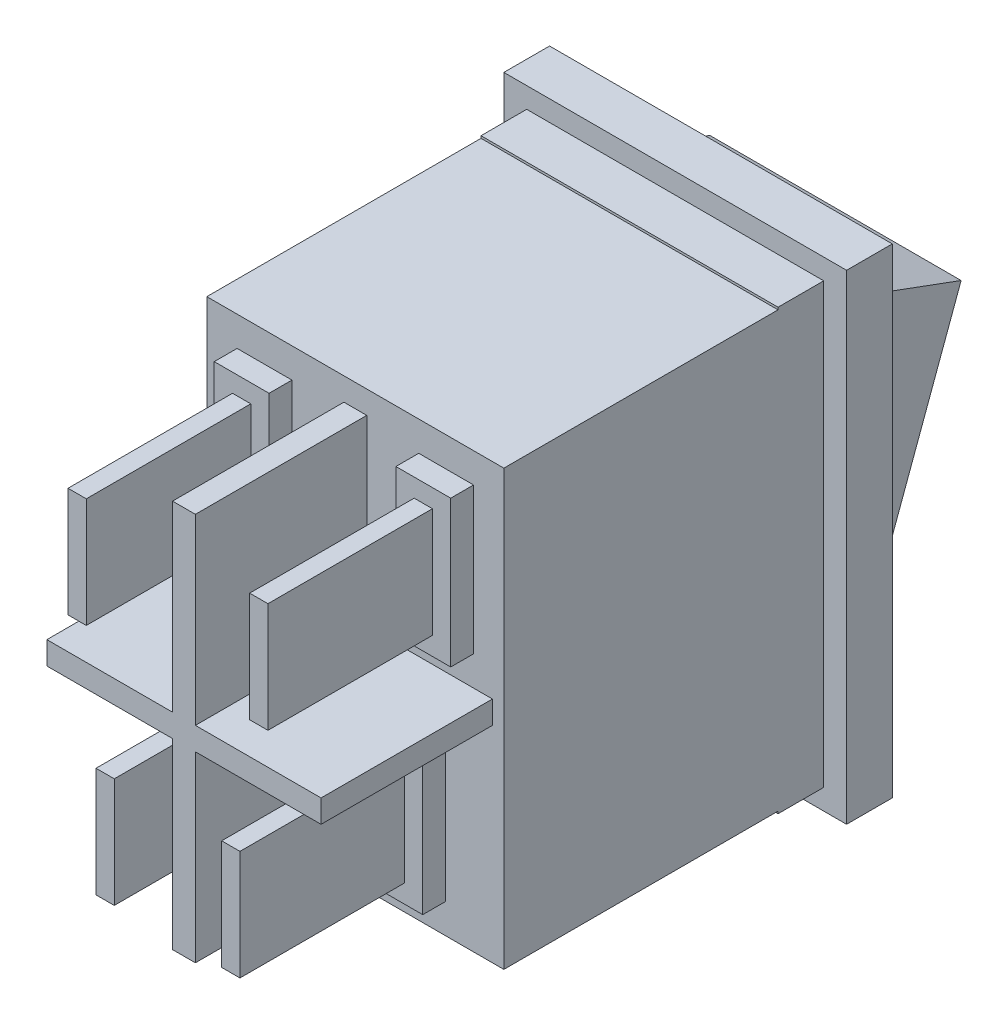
ISO-10303-21;
HEADER;
FILE_DESCRIPTION(('STEP AP214'),'2;1');
FILE_NAME('part.step','',(''),(''),'','','');
FILE_SCHEMA(('AUTOMOTIVE_DESIGN { 1 0 10303 214 1 1 1 1 }'));
ENDSEC;
DATA;
#1=APPLICATION_CONTEXT('core data for automotive mechanical design processes');
#2=APPLICATION_PROTOCOL_DEFINITION('international standard','automotive_design',2000,#1);
#3=PRODUCT_CONTEXT('',#1,'mechanical');
#4=PRODUCT('Part','Part','',(#3));
#5=PRODUCT_RELATED_PRODUCT_CATEGORY('part','',(#4));
#6=PRODUCT_DEFINITION_FORMATION('','',#4);
#7=PRODUCT_DEFINITION_CONTEXT('part definition',#1,'design');
#8=PRODUCT_DEFINITION('design','',#6,#7);
#9=PRODUCT_DEFINITION_SHAPE('','',#8);
#10=(LENGTH_UNIT() NAMED_UNIT(*) SI_UNIT(.MILLI.,.METRE.));
#11=(NAMED_UNIT(*) PLANE_ANGLE_UNIT() SI_UNIT($,.RADIAN.));
#12=(NAMED_UNIT(*) SI_UNIT($,.STERADIAN.) SOLID_ANGLE_UNIT());
#13=UNCERTAINTY_MEASURE_WITH_UNIT(LENGTH_MEASURE(1.E-05),#10,'distance_accuracy_value','');
#14=(GEOMETRIC_REPRESENTATION_CONTEXT(3) GLOBAL_UNCERTAINTY_ASSIGNED_CONTEXT((#13)) GLOBAL_UNIT_ASSIGNED_CONTEXT((#10,
#11,#12)) REPRESENTATION_CONTEXT('',''));
#15=CARTESIAN_POINT('',(0.,0.,0.));
#16=DIRECTION('',(0.,0.,1.));
#17=DIRECTION('',(1.,0.,0.));
#18=AXIS2_PLACEMENT_3D('',#15,#16,#17);
#19=CARTESIAN_POINT('',(-5.5,-28.683398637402,-0.739574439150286));
#20=DIRECTION('',(-1.,0.,0.));
#21=DIRECTION('',(0.,0.,1.));
#22=AXIS2_PLACEMENT_3D('',#19,#20,#21);
#23=PLANE('',#22);
#24=DIRECTION('',(0.,-0.938339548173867,0.345715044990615));
#25=VECTOR('',#24,1.);
#26=CARTESIAN_POINT('',(-5.5,-8.,-2.));
#27=LINE('',#26,#25);
#28=CARTESIAN_POINT('',(-5.5,5.60592344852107,-7.01286815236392));
#29=VERTEX_POINT('',#28);
#30=CARTESIAN_POINT('',(-5.5,-8.,-2.));
#31=VERTEX_POINT('',#30);
#32=EDGE_CURVE('E67',#29,#31,#27,.T.);
#33=ORIENTED_EDGE('',*,*,#32,.T.);
#34=DIRECTION('',(0.,0.345715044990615,0.938339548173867));
#35=VECTOR('',#34,1.);
#36=CARTESIAN_POINT('',(-5.5,-8.,-2.));
#37=LINE('',#36,#35);
#38=CARTESIAN_POINT('',(-5.5,-5.22433089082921,5.53371927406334));
#39=VERTEX_POINT('',#38);
#40=EDGE_CURVE('E13',#31,#39,#37,.T.);
#41=ORIENTED_EDGE('',*,*,#40,.T.);
#42=DIRECTION('',(0.,0.938339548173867,-0.345715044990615));
#43=VECTOR('',#42,1.);
#44=CARTESIAN_POINT('',(-5.5,8.38159255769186,0.520851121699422));
#45=LINE('',#44,#43);
#46=CARTESIAN_POINT('',(-5.5,8.38159255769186,0.520851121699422));
#47=VERTEX_POINT('',#46);
#48=EDGE_CURVE('E122',#39,#47,#45,.T.);
#49=ORIENTED_EDGE('',*,*,#48,.T.);
#50=DIRECTION('',(0.,-0.345715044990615,-0.938339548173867));
#51=VECTOR('',#50,1.);
#52=CARTESIAN_POINT('',(-5.5,5.60592344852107,-7.01286815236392));
#53=LINE('',#52,#51);
#54=EDGE_CURVE('E118',#47,#29,#53,.T.);
#55=ORIENTED_EDGE('',*,*,#54,.T.);
#56=EDGE_LOOP('',(#33,#41,#49,#55));
#57=FACE_BOUND('',#56,.T.);
#58=ADVANCED_FACE('F41',(#57),#23,.T.);
#59=CARTESIAN_POINT('',(0.,-8.,-2.));
#60=DIRECTION('',(0.,-0.345715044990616,-0.938339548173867));
#61=DIRECTION('',(0.,0.938339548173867,-0.345715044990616));
#62=AXIS2_PLACEMENT_3D('',#59,#60,#61);
#63=PLANE('',#62);
#64=ORIENTED_EDGE('',*,*,#32,.F.);
#65=DIRECTION('',(-1.,0.,0.));
#66=VECTOR('',#65,1.);
#67=CARTESIAN_POINT('',(0.,5.60592344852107,-7.01286815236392));
#68=LINE('',#67,#66);
#69=CARTESIAN_POINT('',(5.5,5.60592344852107,-7.01286815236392));
#70=VERTEX_POINT('',#69);
#71=EDGE_CURVE('E86',#70,#29,#68,.T.);
#72=ORIENTED_EDGE('',*,*,#71,.F.);
#73=DIRECTION('',(0.,-0.938339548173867,0.345715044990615));
#74=VECTOR('',#73,1.);
#75=CARTESIAN_POINT('',(5.5,-8.,-2.));
#76=LINE('',#75,#74);
#77=CARTESIAN_POINT('',(5.5,-8.,-2.));
#78=VERTEX_POINT('',#77);
#79=EDGE_CURVE('E90',#70,#78,#76,.T.);
#80=ORIENTED_EDGE('',*,*,#79,.T.);
#81=DIRECTION('',(-1.,0.,0.));
#82=VECTOR('',#81,1.);
#83=CARTESIAN_POINT('',(0.,-8.,-2.));
#84=LINE('',#83,#82);
#85=EDGE_CURVE('E81',#78,#31,#84,.T.);
#86=ORIENTED_EDGE('',*,*,#85,.T.);
#87=EDGE_LOOP('',(#64,#72,#80,#86));
#88=FACE_BOUND('',#87,.T.);
#89=ADVANCED_FACE('F88',(#88),#63,.T.);
#90=CARTESIAN_POINT('',(0.,5.60592344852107,-7.01286815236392));
#91=DIRECTION('',(0.,0.938339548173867,-0.345715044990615));
#92=DIRECTION('',(0.,0.345715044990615,0.938339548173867));
#93=AXIS2_PLACEMENT_3D('',#90,#91,#92);
#94=PLANE('',#93);
#95=ORIENTED_EDGE('',*,*,#54,.F.);
#96=DIRECTION('',(-1.,0.,0.));
#97=VECTOR('',#96,1.);
#98=CARTESIAN_POINT('',(0.,8.38159255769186,0.520851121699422));
#99=LINE('',#98,#97);
#100=CARTESIAN_POINT('',(5.5,8.38159255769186,0.520851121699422));
#101=VERTEX_POINT('',#100);
#102=EDGE_CURVE('E98',#101,#47,#99,.T.);
#103=ORIENTED_EDGE('',*,*,#102,.F.);
#104=DIRECTION('',(0.,-0.345715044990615,-0.938339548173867));
#105=VECTOR('',#104,1.);
#106=CARTESIAN_POINT('',(5.5,5.60592344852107,-7.01286815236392));
#107=LINE('',#106,#105);
#108=EDGE_CURVE('E95',#101,#70,#107,.T.);
#109=ORIENTED_EDGE('',*,*,#108,.T.);
#110=ORIENTED_EDGE('',*,*,#71,.T.);
#111=EDGE_LOOP('',(#95,#103,#109,#110));
#112=FACE_BOUND('',#111,.T.);
#113=ADVANCED_FACE('F96',(#112),#94,.T.);
#114=CARTESIAN_POINT('',(0.,8.38159255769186,0.520851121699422));
#115=DIRECTION('',(0.,0.345715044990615,0.938339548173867));
#116=DIRECTION('',(0.,-0.938339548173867,0.345715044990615));
#117=AXIS2_PLACEMENT_3D('',#114,#115,#116);
#118=PLANE('',#117);
#119=ORIENTED_EDGE('',*,*,#48,.F.);
#120=DIRECTION('',(-1.,0.,0.));
#121=VECTOR('',#120,1.);
#122=CARTESIAN_POINT('',(0.,-5.22433089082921,5.53371927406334));
#123=LINE('',#122,#121);
#124=CARTESIAN_POINT('',(5.5,-5.22433089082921,5.53371927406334));
#125=VERTEX_POINT('',#124);
#126=EDGE_CURVE('E50',#125,#39,#123,.T.);
#127=ORIENTED_EDGE('',*,*,#126,.F.);
#128=DIRECTION('',(0.,0.938339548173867,-0.345715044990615));
#129=VECTOR('',#128,1.);
#130=CARTESIAN_POINT('',(5.5,8.38159255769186,0.520851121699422));
#131=LINE('',#130,#129);
#132=EDGE_CURVE('E101',#125,#101,#131,.T.);
#133=ORIENTED_EDGE('',*,*,#132,.T.);
#134=ORIENTED_EDGE('',*,*,#102,.T.);
#135=EDGE_LOOP('',(#119,#127,#133,#134));
#136=FACE_BOUND('',#135,.T.);
#137=ADVANCED_FACE('F138',(#136),#118,.T.);
#138=CARTESIAN_POINT('',(0.,-8.,-2.));
#139=DIRECTION('',(0.,-0.938339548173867,0.345715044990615));
#140=DIRECTION('',(0.,-0.345715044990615,-0.938339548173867));
#141=AXIS2_PLACEMENT_3D('',#138,#139,#140);
#142=PLANE('',#141);
#143=ORIENTED_EDGE('',*,*,#40,.F.);
#144=ORIENTED_EDGE('',*,*,#85,.F.);
#145=DIRECTION('',(0.,0.345715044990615,0.938339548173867));
#146=VECTOR('',#145,1.);
#147=CARTESIAN_POINT('',(5.5,-8.,-2.));
#148=LINE('',#147,#146);
#149=EDGE_CURVE('E104',#78,#125,#148,.T.);
#150=ORIENTED_EDGE('',*,*,#149,.T.);
#151=ORIENTED_EDGE('',*,*,#126,.T.);
#152=EDGE_LOOP('',(#143,#144,#150,#151));
#153=FACE_BOUND('',#152,.T.);
#154=ADVANCED_FACE('F140',(#153),#142,.T.);
#155=CARTESIAN_POINT('',(5.5,-28.683398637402,-0.739574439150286));
#156=DIRECTION('',(-1.,0.,0.));
#157=DIRECTION('',(0.,0.,1.));
#158=AXIS2_PLACEMENT_3D('',#155,#156,#157);
#159=PLANE('',#158);
#160=ORIENTED_EDGE('',*,*,#79,.F.);
#161=ORIENTED_EDGE('',*,*,#108,.F.);
#162=ORIENTED_EDGE('',*,*,#132,.F.);
#163=ORIENTED_EDGE('',*,*,#149,.F.);
#164=EDGE_LOOP('',(#160,#161,#162,#163));
#165=FACE_BOUND('',#164,.T.);
#166=ADVANCED_FACE('F103',(#165),#159,.F.);
#167=CLOSED_SHELL('',(#58,#89,#113,#137,#154,#166));
#168=MANIFOLD_SOLID_BREP('B2',#167);
#169=CARTESIAN_POINT('',(7.5,-10.5,0.));
#170=DIRECTION('',(0.,0.,-1.));
#171=DIRECTION('',(-1.,0.,0.));
#172=AXIS2_PLACEMENT_3D('',#169,#170,#171);
#173=PLANE('',#172);
#174=DIRECTION('',(0.,-1.,0.));
#175=VECTOR('',#174,1.);
#176=CARTESIAN_POINT('',(7.5,10.5,0.));
#177=LINE('',#176,#175);
#178=CARTESIAN_POINT('',(7.5,10.5,0.));
#179=VERTEX_POINT('',#178);
#180=CARTESIAN_POINT('',(7.5,-10.5,0.));
#181=VERTEX_POINT('',#180);
#182=EDGE_CURVE('E974',#179,#181,#177,.T.);
#183=ORIENTED_EDGE('',*,*,#182,.F.);
#184=DIRECTION('',(1.,0.,0.));
#185=VECTOR('',#184,1.);
#186=CARTESIAN_POINT('',(7.5,10.5,0.));
#187=LINE('',#186,#185);
#188=CARTESIAN_POINT('',(-7.5,10.5,0.));
#189=VERTEX_POINT('',#188);
#190=EDGE_CURVE('E985',#189,#179,#187,.T.);
#191=ORIENTED_EDGE('',*,*,#190,.F.);
#192=DIRECTION('',(0.,1.,0.));
#193=VECTOR('',#192,1.);
#194=CARTESIAN_POINT('',(-7.5,10.5,0.));
#195=LINE('',#194,#193);
#196=CARTESIAN_POINT('',(-7.5,-10.5,0.));
#197=VERTEX_POINT('',#196);
#198=EDGE_CURVE('E996',#197,#189,#195,.T.);
#199=ORIENTED_EDGE('',*,*,#198,.F.);
#200=DIRECTION('',(-1.,0.,0.));
#201=VECTOR('',#200,1.);
#202=CARTESIAN_POINT('',(7.5,-10.5,0.));
#203=LINE('',#202,#201);
#204=EDGE_CURVE('E994',#181,#197,#203,.T.);
#205=ORIENTED_EDGE('',*,*,#204,.F.);
#206=EDGE_LOOP('',(#183,#191,#199,#205));
#207=FACE_BOUND('',#206,.T.);
#208=DIRECTION('',(1.,0.,0.));
#209=VECTOR('',#208,1.);
#210=CARTESIAN_POINT('',(-6.5,-9.6,0.));
#211=LINE('',#210,#209);
#212=CARTESIAN_POINT('',(-6.5,-9.6,0.));
#213=VERTEX_POINT('',#212);
#214=CARTESIAN_POINT('',(6.5,-9.6,0.));
#215=VERTEX_POINT('',#214);
#216=EDGE_CURVE('E582',#213,#215,#211,.T.);
#217=ORIENTED_EDGE('',*,*,#216,.F.);
#218=DIRECTION('',(0.,-1.,0.));
#219=VECTOR('',#218,1.);
#220=CARTESIAN_POINT('',(-6.5,9.5,0.));
#221=LINE('',#220,#219);
#222=CARTESIAN_POINT('',(-6.5,9.6,0.));
#223=VERTEX_POINT('',#222);
#224=EDGE_CURVE('E586',#223,#213,#221,.T.);
#225=ORIENTED_EDGE('',*,*,#224,.F.);
#226=DIRECTION('',(-1.,0.,0.));
#227=VECTOR('',#226,1.);
#228=CARTESIAN_POINT('',(-6.5,9.6,0.));
#229=LINE('',#228,#227);
#230=CARTESIAN_POINT('',(6.5,9.6,0.));
#231=VERTEX_POINT('',#230);
#232=EDGE_CURVE('E587',#231,#223,#229,.T.);
#233=ORIENTED_EDGE('',*,*,#232,.F.);
#234=DIRECTION('',(0.,1.,0.));
#235=VECTOR('',#234,1.);
#236=CARTESIAN_POINT('',(6.5,9.5,0.));
#237=LINE('',#236,#235);
#238=EDGE_CURVE('E1010',#215,#231,#237,.T.);
#239=ORIENTED_EDGE('',*,*,#238,.F.);
#240=EDGE_LOOP('',(#217,#225,#233,#239));
#241=FACE_BOUND('',#240,.T.);
#242=ADVANCED_FACE('F188',(#207,#241),#173,.F.);
#243=CARTESIAN_POINT('',(6.5,9.5,14.));
#244=DIRECTION('',(0.,-1.,0.));
#245=DIRECTION('',(0.,0.,-1.));
#246=AXIS2_PLACEMENT_3D('',#243,#244,#245);
#247=PLANE('',#246);
#248=DIRECTION('',(1.,0.,0.));
#249=VECTOR('',#248,1.);
#250=CARTESIAN_POINT('',(-6.5,9.5,2.));
#251=LINE('',#250,#249);
#252=CARTESIAN_POINT('',(-6.5,9.5,2.));
#253=VERTEX_POINT('',#252);
#254=CARTESIAN_POINT('',(6.5,9.5,2.));
#255=VERTEX_POINT('',#254);
#256=EDGE_CURVE('E597',#253,#255,#251,.T.);
#257=ORIENTED_EDGE('',*,*,#256,.F.);
#258=DIRECTION('',(0.,0.,-1.));
#259=VECTOR('',#258,1.);
#260=CARTESIAN_POINT('',(-6.5,9.5,14.));
#261=LINE('',#260,#259);
#262=CARTESIAN_POINT('',(-6.5,9.5,14.));
#263=VERTEX_POINT('',#262);
#264=EDGE_CURVE('E1027',#263,#253,#261,.T.);
#265=ORIENTED_EDGE('',*,*,#264,.F.);
#266=DIRECTION('',(-1.,0.,0.));
#267=VECTOR('',#266,1.);
#268=CARTESIAN_POINT('',(6.5,9.5,14.));
#269=LINE('',#268,#267);
#270=CARTESIAN_POINT('',(6.5,9.5,14.));
#271=VERTEX_POINT('',#270);
#272=EDGE_CURVE('E1014',#271,#263,#269,.T.);
#273=ORIENTED_EDGE('',*,*,#272,.F.);
#274=DIRECTION('',(0.,0.,-1.));
#275=VECTOR('',#274,1.);
#276=CARTESIAN_POINT('',(6.5,9.5,14.));
#277=LINE('',#276,#275);
#278=EDGE_CURVE('E211',#271,#255,#277,.T.);
#279=ORIENTED_EDGE('',*,*,#278,.T.);
#280=EDGE_LOOP('',(#257,#265,#273,#279));
#281=FACE_BOUND('',#280,.T.);
#282=ADVANCED_FACE('F1075',(#281),#247,.F.);
#283=CARTESIAN_POINT('',(6.5,-9.5,14.));
#284=DIRECTION('',(0.,0.,-1.));
#285=DIRECTION('',(-1.,0.,0.));
#286=AXIS2_PLACEMENT_3D('',#283,#284,#285);
#287=PLANE('',#286);
#288=DIRECTION('',(0.,-1.,0.));
#289=VECTOR('',#288,1.);
#290=CARTESIAN_POINT('',(-3.95,-1.8,14.));
#291=LINE('',#290,#289);
#292=CARTESIAN_POINT('',(-3.95,-1.8,14.));
#293=VERTEX_POINT('',#292);
#294=CARTESIAN_POINT('',(-3.95,-8.2,14.));
#295=VERTEX_POINT('',#294);
#296=EDGE_CURVE('E650',#293,#295,#291,.T.);
#297=ORIENTED_EDGE('',*,*,#296,.F.);
#298=DIRECTION('',(-1.,0.,0.));
#299=VECTOR('',#298,1.);
#300=CARTESIAN_POINT('',(-3.95,-1.8,14.));
#301=LINE('',#300,#299);
#302=CARTESIAN_POINT('',(-1.55,-1.8,14.));
#303=VERTEX_POINT('',#302);
#304=EDGE_CURVE('E655',#303,#293,#301,.T.);
#305=ORIENTED_EDGE('',*,*,#304,.F.);
#306=DIRECTION('',(0.,1.,0.));
#307=VECTOR('',#306,1.);
#308=CARTESIAN_POINT('',(-1.55,-1.8,14.));
#309=LINE('',#308,#307);
#310=CARTESIAN_POINT('',(-1.55,-8.2,14.));
#311=VERTEX_POINT('',#310);
#312=EDGE_CURVE('E667',#311,#303,#309,.T.);
#313=ORIENTED_EDGE('',*,*,#312,.F.);
#314=DIRECTION('',(1.,0.,0.));
#315=VECTOR('',#314,1.);
#316=CARTESIAN_POINT('',(-3.95,-8.2,14.));
#317=LINE('',#316,#315);
#318=EDGE_CURVE('E664',#295,#311,#317,.T.);
#319=ORIENTED_EDGE('',*,*,#318,.F.);
#320=EDGE_LOOP('',(#297,#305,#313,#319));
#321=FACE_BOUND('',#320,.T.);
#322=DIRECTION('',(0.,-1.,0.));
#323=VECTOR('',#322,1.);
#324=CARTESIAN_POINT('',(-6.,0.5,14.));
#325=LINE('',#324,#323);
#326=CARTESIAN_POINT('',(-6.,0.5,14.));
#327=VERTEX_POINT('',#326);
#328=CARTESIAN_POINT('',(-6.,-0.5,14.));
#329=VERTEX_POINT('',#328);
#330=EDGE_CURVE('E851',#327,#329,#325,.T.);
#331=ORIENTED_EDGE('',*,*,#330,.F.);
#332=DIRECTION('',(-1.,0.,0.));
#333=VECTOR('',#332,1.);
#334=CARTESIAN_POINT('',(-6.,0.5,14.));
#335=LINE('',#334,#333);
#336=CARTESIAN_POINT('',(-0.5,0.5,14.));
#337=VERTEX_POINT('',#336);
#338=EDGE_CURVE('E856',#337,#327,#335,.T.);
#339=ORIENTED_EDGE('',*,*,#338,.F.);
#340=DIRECTION('',(0.,-1.,0.));
#341=VECTOR('',#340,1.);
#342=CARTESIAN_POINT('',(-0.5,8.5,14.));
#343=LINE('',#342,#341);
#344=CARTESIAN_POINT('',(-0.5,8.5,14.));
#345=VERTEX_POINT('',#344);
#346=EDGE_CURVE('E908',#345,#337,#343,.T.);
#347=ORIENTED_EDGE('',*,*,#346,.F.);
#348=DIRECTION('',(-1.,0.,0.));
#349=VECTOR('',#348,1.);
#350=CARTESIAN_POINT('',(0.5,8.5,14.));
#351=LINE('',#350,#349);
#352=CARTESIAN_POINT('',(0.5,8.5,14.));
#353=VERTEX_POINT('',#352);
#354=EDGE_CURVE('E905',#353,#345,#351,.T.);
#355=ORIENTED_EDGE('',*,*,#354,.F.);
#356=DIRECTION('',(0.,1.,0.));
#357=VECTOR('',#356,1.);
#358=CARTESIAN_POINT('',(0.5,0.5,14.));
#359=LINE('',#358,#357);
#360=CARTESIAN_POINT('',(0.5,0.5,14.));
#361=VERTEX_POINT('',#360);
#362=EDGE_CURVE('E902',#361,#353,#359,.T.);
#363=ORIENTED_EDGE('',*,*,#362,.F.);
#364=DIRECTION('',(-1.,0.,0.));
#365=VECTOR('',#364,1.);
#366=CARTESIAN_POINT('',(6.,0.5,14.));
#367=LINE('',#366,#365);
#368=CARTESIAN_POINT('',(6.,0.5,14.));
#369=VERTEX_POINT('',#368);
#370=EDGE_CURVE('E899',#369,#361,#367,.T.);
#371=ORIENTED_EDGE('',*,*,#370,.F.);
#372=DIRECTION('',(0.,1.,0.));
#373=VECTOR('',#372,1.);
#374=CARTESIAN_POINT('',(6.,-0.5,14.));
#375=LINE('',#374,#373);
#376=CARTESIAN_POINT('',(6.,-0.5,14.));
#377=VERTEX_POINT('',#376);
#378=EDGE_CURVE('E896',#377,#369,#375,.T.);
#379=ORIENTED_EDGE('',*,*,#378,.F.);
#380=DIRECTION('',(1.,0.,0.));
#381=VECTOR('',#380,1.);
#382=CARTESIAN_POINT('',(0.5,-0.5,14.));
#383=LINE('',#382,#381);
#384=CARTESIAN_POINT('',(0.5,-0.5,14.));
#385=VERTEX_POINT('',#384);
#386=EDGE_CURVE('E893',#385,#377,#383,.T.);
#387=ORIENTED_EDGE('',*,*,#386,.F.);
#388=DIRECTION('',(0.,1.,0.));
#389=VECTOR('',#388,1.);
#390=CARTESIAN_POINT('',(0.5,-8.5,14.));
#391=LINE('',#390,#389);
#392=CARTESIAN_POINT('',(0.5,-8.5,14.));
#393=VERTEX_POINT('',#392);
#394=EDGE_CURVE('E890',#393,#385,#391,.T.);
#395=ORIENTED_EDGE('',*,*,#394,.F.);
#396=DIRECTION('',(1.,0.,0.));
#397=VECTOR('',#396,1.);
#398=CARTESIAN_POINT('',(-0.5,-8.5,14.));
#399=LINE('',#398,#397);
#400=CARTESIAN_POINT('',(-0.5,-8.5,14.));
#401=VERTEX_POINT('',#400);
#402=EDGE_CURVE('E887',#401,#393,#399,.T.);
#403=ORIENTED_EDGE('',*,*,#402,.F.);
#404=DIRECTION('',(0.,-1.,0.));
#405=VECTOR('',#404,1.);
#406=CARTESIAN_POINT('',(-0.5,-0.5,14.));
#407=LINE('',#406,#405);
#408=CARTESIAN_POINT('',(-0.5,-0.5,14.));
#409=VERTEX_POINT('',#408);
#410=EDGE_CURVE('E884',#409,#401,#407,.T.);
#411=ORIENTED_EDGE('',*,*,#410,.F.);
#412=DIRECTION('',(1.,0.,0.));
#413=VECTOR('',#412,1.);
#414=CARTESIAN_POINT('',(-6.,-0.5,14.));
#415=LINE('',#414,#413);
#416=EDGE_CURVE('E881',#329,#409,#415,.T.);
#417=ORIENTED_EDGE('',*,*,#416,.F.);
#418=EDGE_LOOP('',(#331,#339,#347,#355,#363,#371,#379,#387,#395,#403,#411,#417));
#419=FACE_BOUND('',#418,.T.);
#420=DIRECTION('',(0.,1.,0.));
#421=VECTOR('',#420,1.);
#422=CARTESIAN_POINT('',(6.5,9.5,14.));
#423=LINE('',#422,#421);
#424=CARTESIAN_POINT('',(6.5,-9.5,14.));
#425=VERTEX_POINT('',#424);
#426=EDGE_CURVE('E1011',#425,#271,#423,.T.);
#427=ORIENTED_EDGE('',*,*,#426,.T.);
#428=ORIENTED_EDGE('',*,*,#272,.T.);
#429=DIRECTION('',(0.,-1.,0.));
#430=VECTOR('',#429,1.);
#431=CARTESIAN_POINT('',(-6.5,9.5,14.));
#432=LINE('',#431,#430);
#433=CARTESIAN_POINT('',(-6.5,-9.5,14.));
#434=VERTEX_POINT('',#433);
#435=EDGE_CURVE('E1016',#263,#434,#432,.T.);
#436=ORIENTED_EDGE('',*,*,#435,.T.);
#437=DIRECTION('',(1.,0.,0.));
#438=VECTOR('',#437,1.);
#439=CARTESIAN_POINT('',(6.5,-9.5,14.));
#440=LINE('',#439,#438);
#441=EDGE_CURVE('E1018',#434,#425,#440,.T.);
#442=ORIENTED_EDGE('',*,*,#441,.T.);
#443=EDGE_LOOP('',(#427,#428,#436,#442));
#444=FACE_BOUND('',#443,.T.);
#445=DIRECTION('',(0.,-1.,0.));
#446=VECTOR('',#445,1.);
#447=CARTESIAN_POINT('',(-5.175,1.8,14.));
#448=LINE('',#447,#446);
#449=CARTESIAN_POINT('',(-5.175,8.2,14.));
#450=VERTEX_POINT('',#449);
#451=CARTESIAN_POINT('',(-5.175,1.8,14.));
#452=VERTEX_POINT('',#451);
#453=EDGE_CURVE('E818',#450,#452,#448,.T.);
#454=ORIENTED_EDGE('',*,*,#453,.F.);
#455=DIRECTION('',(-1.,0.,0.));
#456=VECTOR('',#455,1.);
#457=CARTESIAN_POINT('',(-5.175,8.2,14.));
#458=LINE('',#457,#456);
#459=CARTESIAN_POINT('',(-2.775,8.2,14.));
#460=VERTEX_POINT('',#459);
#461=EDGE_CURVE('E823',#460,#450,#458,.T.);
#462=ORIENTED_EDGE('',*,*,#461,.F.);
#463=DIRECTION('',(0.,1.,0.));
#464=VECTOR('',#463,1.);
#465=CARTESIAN_POINT('',(-2.775,8.2,14.));
#466=LINE('',#465,#464);
#467=CARTESIAN_POINT('',(-2.775,1.8,14.));
#468=VERTEX_POINT('',#467);
#469=EDGE_CURVE('E835',#468,#460,#466,.T.);
#470=ORIENTED_EDGE('',*,*,#469,.F.);
#471=DIRECTION('',(1.,0.,0.));
#472=VECTOR('',#471,1.);
#473=CARTESIAN_POINT('',(-2.775,1.8,14.));
#474=LINE('',#473,#472);
#475=EDGE_CURVE('E832',#452,#468,#474,.T.);
#476=ORIENTED_EDGE('',*,*,#475,.F.);
#477=EDGE_LOOP('',(#454,#462,#470,#476));
#478=FACE_BOUND('',#477,.T.);
#479=DIRECTION('',(0.,-1.,0.));
#480=VECTOR('',#479,1.);
#481=CARTESIAN_POINT('',(2.775,8.2,14.));
#482=LINE('',#481,#480);
#483=CARTESIAN_POINT('',(2.775,8.2,14.));
#484=VERTEX_POINT('',#483);
#485=CARTESIAN_POINT('',(2.775,1.8,14.));
#486=VERTEX_POINT('',#485);
#487=EDGE_CURVE('E692',#484,#486,#482,.T.);
#488=ORIENTED_EDGE('',*,*,#487,.F.);
#489=DIRECTION('',(-1.,0.,0.));
#490=VECTOR('',#489,1.);
#491=CARTESIAN_POINT('',(2.775,8.2,14.));
#492=LINE('',#491,#490);
#493=CARTESIAN_POINT('',(5.175,8.2,14.));
#494=VERTEX_POINT('',#493);
#495=EDGE_CURVE('E697',#494,#484,#492,.T.);
#496=ORIENTED_EDGE('',*,*,#495,.F.);
#497=DIRECTION('',(0.,1.,0.));
#498=VECTOR('',#497,1.);
#499=CARTESIAN_POINT('',(5.175,8.2,14.));
#500=LINE('',#499,#498);
#501=CARTESIAN_POINT('',(5.175,1.8,14.));
#502=VERTEX_POINT('',#501);
#503=EDGE_CURVE('E709',#502,#494,#500,.T.);
#504=ORIENTED_EDGE('',*,*,#503,.F.);
#505=DIRECTION('',(1.,0.,0.));
#506=VECTOR('',#505,1.);
#507=CARTESIAN_POINT('',(2.775,1.8,14.));
#508=LINE('',#507,#506);
#509=EDGE_CURVE('E706',#486,#502,#508,.T.);
#510=ORIENTED_EDGE('',*,*,#509,.F.);
#511=EDGE_LOOP('',(#488,#496,#504,#510));
#512=FACE_BOUND('',#511,.T.);
#513=DIRECTION('',(0.,-1.,0.));
#514=VECTOR('',#513,1.);
#515=CARTESIAN_POINT('',(1.55,-1.8,14.));
#516=LINE('',#515,#514);
#517=CARTESIAN_POINT('',(1.55,-1.8,14.));
#518=VERTEX_POINT('',#517);
#519=CARTESIAN_POINT('',(1.55,-8.2,14.));
#520=VERTEX_POINT('',#519);
#521=EDGE_CURVE('E608',#518,#520,#516,.T.);
#522=ORIENTED_EDGE('',*,*,#521,.F.);
#523=DIRECTION('',(-1.,0.,0.));
#524=VECTOR('',#523,1.);
#525=CARTESIAN_POINT('',(1.55,-1.8,14.));
#526=LINE('',#525,#524);
#527=CARTESIAN_POINT('',(3.95,-1.8,14.));
#528=VERTEX_POINT('',#527);
#529=EDGE_CURVE('E613',#528,#518,#526,.T.);
#530=ORIENTED_EDGE('',*,*,#529,.F.);
#531=DIRECTION('',(0.,1.,0.));
#532=VECTOR('',#531,1.);
#533=CARTESIAN_POINT('',(3.95,-1.8,14.));
#534=LINE('',#533,#532);
#535=CARTESIAN_POINT('',(3.95,-8.2,14.));
#536=VERTEX_POINT('',#535);
#537=EDGE_CURVE('E625',#536,#528,#534,.T.);
#538=ORIENTED_EDGE('',*,*,#537,.F.);
#539=DIRECTION('',(1.,0.,0.));
#540=VECTOR('',#539,1.);
#541=CARTESIAN_POINT('',(1.55,-8.2,14.));
#542=LINE('',#541,#540);
#543=EDGE_CURVE('E622',#520,#536,#542,.T.);
#544=ORIENTED_EDGE('',*,*,#543,.F.);
#545=EDGE_LOOP('',(#522,#530,#538,#544));
#546=FACE_BOUND('',#545,.T.);
#547=ADVANCED_FACE('F1081',(#321,#419,#444,#478,#512,#546),#287,.F.);
#548=CARTESIAN_POINT('',(-5.175,8.2,15.));
#549=DIRECTION('',(0.,0.,-1.));
#550=DIRECTION('',(-1.,0.,0.));
#551=AXIS2_PLACEMENT_3D('',#548,#549,#550);
#552=PLANE('',#551);
#553=DIRECTION('',(0.,-1.,0.));
#554=VECTOR('',#553,1.);
#555=CARTESIAN_POINT('',(-5.175,1.8,15.));
#556=LINE('',#555,#554);
#557=CARTESIAN_POINT('',(-5.175,8.2,15.));
#558=VERTEX_POINT('',#557);
#559=CARTESIAN_POINT('',(-5.175,1.8,15.));
#560=VERTEX_POINT('',#559);
#561=EDGE_CURVE('E819',#558,#560,#556,.T.);
#562=ORIENTED_EDGE('',*,*,#561,.T.);
#563=DIRECTION('',(1.,0.,0.));
#564=VECTOR('',#563,1.);
#565=CARTESIAN_POINT('',(-2.775,1.8,15.));
#566=LINE('',#565,#564);
#567=CARTESIAN_POINT('',(-2.775,1.8,15.));
#568=VERTEX_POINT('',#567);
#569=EDGE_CURVE('E822',#560,#568,#566,.T.);
#570=ORIENTED_EDGE('',*,*,#569,.T.);
#571=DIRECTION('',(0.,1.,0.));
#572=VECTOR('',#571,1.);
#573=CARTESIAN_POINT('',(-2.775,8.2,15.));
#574=LINE('',#573,#572);
#575=CARTESIAN_POINT('',(-2.775,8.2,15.));
#576=VERTEX_POINT('',#575);
#577=EDGE_CURVE('E825',#568,#576,#574,.T.);
#578=ORIENTED_EDGE('',*,*,#577,.T.);
#579=DIRECTION('',(-1.,0.,0.));
#580=VECTOR('',#579,1.);
#581=CARTESIAN_POINT('',(-5.175,8.2,15.));
#582=LINE('',#581,#580);
#583=EDGE_CURVE('E827',#576,#558,#582,.T.);
#584=ORIENTED_EDGE('',*,*,#583,.T.);
#585=EDGE_LOOP('',(#562,#570,#578,#584));
#586=FACE_BOUND('',#585,.T.);
#587=DIRECTION('',(0.,-1.,0.));
#588=VECTOR('',#587,1.);
#589=CARTESIAN_POINT('',(-4.375,8.2,15.));
#590=LINE('',#589,#588);
#591=CARTESIAN_POINT('',(-4.375,7.4,15.));
#592=VERTEX_POINT('',#591);
#593=CARTESIAN_POINT('',(-4.375,2.6,15.));
#594=VERTEX_POINT('',#593);
#595=EDGE_CURVE('E1040',#592,#594,#590,.T.);
#596=ORIENTED_EDGE('',*,*,#595,.F.);
#597=DIRECTION('',(-1.,0.,0.));
#598=VECTOR('',#597,1.);
#599=CARTESIAN_POINT('',(-5.175,7.4,15.));
#600=LINE('',#599,#598);
#601=CARTESIAN_POINT('',(-3.575,7.4,15.));
#602=VERTEX_POINT('',#601);
#603=EDGE_CURVE('E1031',#602,#592,#600,.T.);
#604=ORIENTED_EDGE('',*,*,#603,.F.);
#605=DIRECTION('',(0.,1.,0.));
#606=VECTOR('',#605,1.);
#607=CARTESIAN_POINT('',(-3.575,8.2,15.));
#608=LINE('',#607,#606);
#609=CARTESIAN_POINT('',(-3.575,2.6,15.));
#610=VERTEX_POINT('',#609);
#611=EDGE_CURVE('E1034',#610,#602,#608,.T.);
#612=ORIENTED_EDGE('',*,*,#611,.F.);
#613=DIRECTION('',(1.,0.,0.));
#614=VECTOR('',#613,1.);
#615=CARTESIAN_POINT('',(-5.175,2.6,15.));
#616=LINE('',#615,#614);
#617=EDGE_CURVE('E1037',#594,#610,#616,.T.);
#618=ORIENTED_EDGE('',*,*,#617,.F.);
#619=EDGE_LOOP('',(#596,#604,#612,#618));
#620=FACE_BOUND('',#619,.T.);
#621=ADVANCED_FACE('F1107',(#586,#620),#552,.F.);
#622=CARTESIAN_POINT('',(6.5,9.5,14.));
#623=DIRECTION('',(-1.,0.,0.));
#624=DIRECTION('',(0.,0.,1.));
#625=AXIS2_PLACEMENT_3D('',#622,#623,#624);
#626=PLANE('',#625);
#627=ORIENTED_EDGE('',*,*,#238,.T.);
#628=DIRECTION('',(0.,0.,-1.));
#629=VECTOR('',#628,1.);
#630=CARTESIAN_POINT('',(6.5,9.6,2.));
#631=LINE('',#630,#629);
#632=CARTESIAN_POINT('',(6.5,9.6,2.));
#633=VERTEX_POINT('',#632);
#634=EDGE_CURVE('E605',#633,#231,#631,.T.);
#635=ORIENTED_EDGE('',*,*,#634,.F.);
#636=DIRECTION('',(0.,1.,0.));
#637=VECTOR('',#636,1.);
#638=CARTESIAN_POINT('',(6.5,9.5,2.));
#639=LINE('',#638,#637);
#640=EDGE_CURVE('E599',#255,#633,#639,.T.);
#641=ORIENTED_EDGE('',*,*,#640,.F.);
#642=ORIENTED_EDGE('',*,*,#278,.F.);
#643=ORIENTED_EDGE('',*,*,#426,.F.);
#644=DIRECTION('',(0.,0.,-1.));
#645=VECTOR('',#644,1.);
#646=CARTESIAN_POINT('',(6.5,-9.5,14.));
#647=LINE('',#646,#645);
#648=CARTESIAN_POINT('',(6.5,-9.5,2.));
#649=VERTEX_POINT('',#648);
#650=EDGE_CURVE('E1020',#425,#649,#647,.T.);
#651=ORIENTED_EDGE('',*,*,#650,.T.);
#652=DIRECTION('',(0.,1.,0.));
#653=VECTOR('',#652,1.);
#654=CARTESIAN_POINT('',(6.5,-9.5,2.));
#655=LINE('',#654,#653);
#656=CARTESIAN_POINT('',(6.5,-9.6,2.));
#657=VERTEX_POINT('',#656);
#658=EDGE_CURVE('E203',#657,#649,#655,.T.);
#659=ORIENTED_EDGE('',*,*,#658,.F.);
#660=DIRECTION('',(0.,0.,-1.));
#661=VECTOR('',#660,1.);
#662=CARTESIAN_POINT('',(6.5,-9.6,2.));
#663=LINE('',#662,#661);
#664=EDGE_CURVE('E573',#657,#215,#663,.T.);
#665=ORIENTED_EDGE('',*,*,#664,.T.);
#666=EDGE_LOOP('',(#627,#635,#641,#642,#643,#651,#659,#665));
#667=FACE_BOUND('',#666,.T.);
#668=ADVANCED_FACE('F190',(#667),#626,.F.);
#669=CARTESIAN_POINT('',(-6.5,9.5,14.));
#670=DIRECTION('',(1.,0.,0.));
#671=DIRECTION('',(0.,0.,-1.));
#672=AXIS2_PLACEMENT_3D('',#669,#670,#671);
#673=PLANE('',#672);
#674=ORIENTED_EDGE('',*,*,#224,.T.);
#675=DIRECTION('',(0.,0.,-1.));
#676=VECTOR('',#675,1.);
#677=CARTESIAN_POINT('',(-6.5,-9.6,2.));
#678=LINE('',#677,#676);
#679=CARTESIAN_POINT('',(-6.5,-9.6,2.));
#680=VERTEX_POINT('',#679);
#681=EDGE_CURVE('E570',#680,#213,#678,.T.);
#682=ORIENTED_EDGE('',*,*,#681,.F.);
#683=DIRECTION('',(0.,-1.,0.));
#684=VECTOR('',#683,1.);
#685=CARTESIAN_POINT('',(-6.5,-9.5,2.));
#686=LINE('',#685,#684);
#687=CARTESIAN_POINT('',(-6.5,-9.5,2.));
#688=VERTEX_POINT('',#687);
#689=EDGE_CURVE('E574',#688,#680,#686,.T.);
#690=ORIENTED_EDGE('',*,*,#689,.F.);
#691=DIRECTION('',(0.,0.,-1.));
#692=VECTOR('',#691,1.);
#693=CARTESIAN_POINT('',(-6.5,-9.5,14.));
#694=LINE('',#693,#692);
#695=EDGE_CURVE('E1025',#434,#688,#694,.T.);
#696=ORIENTED_EDGE('',*,*,#695,.F.);
#697=ORIENTED_EDGE('',*,*,#435,.F.);
#698=ORIENTED_EDGE('',*,*,#264,.T.);
#699=DIRECTION('',(0.,-1.,0.));
#700=VECTOR('',#699,1.);
#701=CARTESIAN_POINT('',(-6.5,9.5,2.));
#702=LINE('',#701,#700);
#703=CARTESIAN_POINT('',(-6.5,9.6,2.));
#704=VERTEX_POINT('',#703);
#705=EDGE_CURVE('E590',#704,#253,#702,.T.);
#706=ORIENTED_EDGE('',*,*,#705,.F.);
#707=DIRECTION('',(0.,0.,-1.));
#708=VECTOR('',#707,1.);
#709=CARTESIAN_POINT('',(-6.5,9.6,2.));
#710=LINE('',#709,#708);
#711=EDGE_CURVE('E602',#704,#223,#710,.T.);
#712=ORIENTED_EDGE('',*,*,#711,.T.);
#713=EDGE_LOOP('',(#674,#682,#690,#696,#697,#698,#706,#712));
#714=FACE_BOUND('',#713,.T.);
#715=ADVANCED_FACE('F584',(#714),#673,.F.);
#716=CARTESIAN_POINT('',(6.5,-9.5,14.));
#717=DIRECTION('',(0.,1.,0.));
#718=DIRECTION('',(-1.,0.,0.));
#719=AXIS2_PLACEMENT_3D('',#716,#717,#718);
#720=PLANE('',#719);
#721=ORIENTED_EDGE('',*,*,#695,.T.);
#722=DIRECTION('',(-1.,0.,0.));
#723=VECTOR('',#722,1.);
#724=CARTESIAN_POINT('',(-6.5,-9.5,2.));
#725=LINE('',#724,#723);
#726=EDGE_CURVE('E578',#649,#688,#725,.T.);
#727=ORIENTED_EDGE('',*,*,#726,.F.);
#728=ORIENTED_EDGE('',*,*,#650,.F.);
#729=ORIENTED_EDGE('',*,*,#441,.F.);
#730=EDGE_LOOP('',(#721,#727,#728,#729));
#731=FACE_BOUND('',#730,.T.);
#732=ADVANCED_FACE('F1103',(#731),#720,.F.);
#733=CARTESIAN_POINT('',(7.5,10.5,-2.));
#734=DIRECTION('',(-1.,0.,0.));
#735=DIRECTION('',(0.,-1.,0.));
#736=AXIS2_PLACEMENT_3D('',#733,#734,#735);
#737=PLANE('',#736);
#738=ORIENTED_EDGE('',*,*,#182,.T.);
#739=DIRECTION('',(0.,0.,1.));
#740=VECTOR('',#739,1.);
#741=CARTESIAN_POINT('',(7.5,-10.5,-2.));
#742=LINE('',#741,#740);
#743=CARTESIAN_POINT('',(7.5,-10.5,-2.));
#744=VERTEX_POINT('',#743);
#745=EDGE_CURVE('E1007',#744,#181,#742,.T.);
#746=ORIENTED_EDGE('',*,*,#745,.F.);
#747=DIRECTION('',(0.,-1.,0.));
#748=VECTOR('',#747,1.);
#749=CARTESIAN_POINT('',(7.5,10.5,-2.));
#750=LINE('',#749,#748);
#751=CARTESIAN_POINT('',(7.5,10.5,-2.));
#752=VERTEX_POINT('',#751);
#753=EDGE_CURVE('E981',#752,#744,#750,.T.);
#754=ORIENTED_EDGE('',*,*,#753,.F.);
#755=DIRECTION('',(0.,0.,1.));
#756=VECTOR('',#755,1.);
#757=CARTESIAN_POINT('',(7.5,10.5,-2.));
#758=LINE('',#757,#756);
#759=EDGE_CURVE('E991',#752,#179,#758,.T.);
#760=ORIENTED_EDGE('',*,*,#759,.T.);
#761=EDGE_LOOP('',(#738,#746,#754,#760));
#762=FACE_BOUND('',#761,.T.);
#763=ADVANCED_FACE('F1099',(#762),#737,.F.);
#764=CARTESIAN_POINT('',(7.5,-10.5,-2.));
#765=DIRECTION('',(0.,1.,0.));
#766=DIRECTION('',(0.,0.,1.));
#767=AXIS2_PLACEMENT_3D('',#764,#765,#766);
#768=PLANE('',#767);
#769=ORIENTED_EDGE('',*,*,#204,.T.);
#770=DIRECTION('',(0.,0.,1.));
#771=VECTOR('',#770,1.);
#772=CARTESIAN_POINT('',(-7.5,-10.5,-2.));
#773=LINE('',#772,#771);
#774=CARTESIAN_POINT('',(-7.5,-10.5,-2.));
#775=VERTEX_POINT('',#774);
#776=EDGE_CURVE('E1004',#775,#197,#773,.T.);
#777=ORIENTED_EDGE('',*,*,#776,.F.);
#778=DIRECTION('',(-1.,0.,0.));
#779=VECTOR('',#778,1.);
#780=CARTESIAN_POINT('',(7.5,-10.5,-2.));
#781=LINE('',#780,#779);
#782=EDGE_CURVE('E984',#744,#775,#781,.T.);
#783=ORIENTED_EDGE('',*,*,#782,.F.);
#784=ORIENTED_EDGE('',*,*,#745,.T.);
#785=EDGE_LOOP('',(#769,#777,#783,#784));
#786=FACE_BOUND('',#785,.T.);
#787=ADVANCED_FACE('F1095',(#786),#768,.F.);
#788=CARTESIAN_POINT('',(-7.5,10.5,-2.));
#789=DIRECTION('',(1.,0.,0.));
#790=DIRECTION('',(0.,1.,0.));
#791=AXIS2_PLACEMENT_3D('',#788,#789,#790);
#792=PLANE('',#791);
#793=ORIENTED_EDGE('',*,*,#198,.T.);
#794=DIRECTION('',(0.,0.,1.));
#795=VECTOR('',#794,1.);
#796=CARTESIAN_POINT('',(-7.5,10.5,-2.));
#797=LINE('',#796,#795);
#798=CARTESIAN_POINT('',(-7.5,10.5,-2.));
#799=VERTEX_POINT('',#798);
#800=EDGE_CURVE('E1001',#799,#189,#797,.T.);
#801=ORIENTED_EDGE('',*,*,#800,.F.);
#802=DIRECTION('',(0.,1.,0.));
#803=VECTOR('',#802,1.);
#804=CARTESIAN_POINT('',(-7.5,10.5,-2.));
#805=LINE('',#804,#803);
#806=EDGE_CURVE('E987',#775,#799,#805,.T.);
#807=ORIENTED_EDGE('',*,*,#806,.F.);
#808=ORIENTED_EDGE('',*,*,#776,.T.);
#809=EDGE_LOOP('',(#793,#801,#807,#808));
#810=FACE_BOUND('',#809,.T.);
#811=ADVANCED_FACE('F1091',(#810),#792,.F.);
#812=CARTESIAN_POINT('',(7.5,10.5,-2.));
#813=DIRECTION('',(0.,-1.,0.));
#814=DIRECTION('',(0.,0.,-1.));
#815=AXIS2_PLACEMENT_3D('',#812,#813,#814);
#816=PLANE('',#815);
#817=ORIENTED_EDGE('',*,*,#190,.T.);
#818=ORIENTED_EDGE('',*,*,#759,.F.);
#819=DIRECTION('',(1.,0.,0.));
#820=VECTOR('',#819,1.);
#821=CARTESIAN_POINT('',(7.5,10.5,-2.));
#822=LINE('',#821,#820);
#823=EDGE_CURVE('E989',#799,#752,#822,.T.);
#824=ORIENTED_EDGE('',*,*,#823,.F.);
#825=ORIENTED_EDGE('',*,*,#800,.T.);
#826=EDGE_LOOP('',(#817,#818,#824,#825));
#827=FACE_BOUND('',#826,.T.);
#828=ADVANCED_FACE('F1088',(#827),#816,.F.);
#829=CARTESIAN_POINT('',(7.5,-10.5,-2.));
#830=DIRECTION('',(0.,0.,-1.));
#831=DIRECTION('',(-1.,0.,0.));
#832=AXIS2_PLACEMENT_3D('',#829,#830,#831);
#833=PLANE('',#832);
#834=DIRECTION('',(0.,-1.,0.));
#835=VECTOR('',#834,1.);
#836=CARTESIAN_POINT('',(5.5,8.,-2.));
#837=LINE('',#836,#835);
#838=CARTESIAN_POINT('',(5.5,8.,-2.));
#839=VERTEX_POINT('',#838);
#840=CARTESIAN_POINT('',(5.5,-8.,-2.));
#841=VERTEX_POINT('',#840);
#842=EDGE_CURVE('E948',#839,#841,#837,.T.);
#843=ORIENTED_EDGE('',*,*,#842,.F.);
#844=DIRECTION('',(1.,0.,0.));
#845=VECTOR('',#844,1.);
#846=CARTESIAN_POINT('',(5.5,8.,-2.));
#847=LINE('',#846,#845);
#848=CARTESIAN_POINT('',(-5.5,8.,-2.));
#849=VERTEX_POINT('',#848);
#850=EDGE_CURVE('E953',#849,#839,#847,.T.);
#851=ORIENTED_EDGE('',*,*,#850,.F.);
#852=DIRECTION('',(0.,1.,0.));
#853=VECTOR('',#852,1.);
#854=CARTESIAN_POINT('',(-5.5,8.,-2.));
#855=LINE('',#854,#853);
#856=CARTESIAN_POINT('',(-5.5,-8.,-2.));
#857=VERTEX_POINT('',#856);
#858=EDGE_CURVE('E967',#857,#849,#855,.T.);
#859=ORIENTED_EDGE('',*,*,#858,.F.);
#860=DIRECTION('',(-1.,0.,0.));
#861=VECTOR('',#860,1.);
#862=CARTESIAN_POINT('',(5.5,-8.,-2.));
#863=LINE('',#862,#861);
#864=EDGE_CURVE('E964',#841,#857,#863,.T.);
#865=ORIENTED_EDGE('',*,*,#864,.F.);
#866=EDGE_LOOP('',(#843,#851,#859,#865));
#867=FACE_BOUND('',#866,.T.);
#868=ORIENTED_EDGE('',*,*,#753,.T.);
#869=ORIENTED_EDGE('',*,*,#782,.T.);
#870=ORIENTED_EDGE('',*,*,#806,.T.);
#871=ORIENTED_EDGE('',*,*,#823,.T.);
#872=EDGE_LOOP('',(#868,#869,#870,#871));
#873=FACE_BOUND('',#872,.T.);
#874=ADVANCED_FACE('F1086',(#867,#873),#833,.T.);
#875=CARTESIAN_POINT('',(5.5,8.,11.));
#876=DIRECTION('',(1.,0.,0.));
#877=DIRECTION('',(0.,1.,0.));
#878=AXIS2_PLACEMENT_3D('',#875,#876,#877);
#879=PLANE('',#878);
#880=ORIENTED_EDGE('',*,*,#842,.T.);
#881=DIRECTION('',(0.,0.,-1.));
#882=VECTOR('',#881,1.);
#883=CARTESIAN_POINT('',(5.5,-8.,11.));
#884=LINE('',#883,#882);
#885=CARTESIAN_POINT('',(5.5,-8.,11.));
#886=VERTEX_POINT('',#885);
#887=EDGE_CURVE('E962',#886,#841,#884,.T.);
#888=ORIENTED_EDGE('',*,*,#887,.F.);
#889=DIRECTION('',(0.,-1.,0.));
#890=VECTOR('',#889,1.);
#891=CARTESIAN_POINT('',(5.5,8.,11.));
#892=LINE('',#891,#890);
#893=CARTESIAN_POINT('',(5.5,8.,11.));
#894=VERTEX_POINT('',#893);
#895=EDGE_CURVE('E949',#894,#886,#892,.T.);
#896=ORIENTED_EDGE('',*,*,#895,.F.);
#897=DIRECTION('',(0.,0.,-1.));
#898=VECTOR('',#897,1.);
#899=CARTESIAN_POINT('',(5.5,8.,11.));
#900=LINE('',#899,#898);
#901=EDGE_CURVE('E972',#894,#839,#900,.T.);
#902=ORIENTED_EDGE('',*,*,#901,.T.);
#903=EDGE_LOOP('',(#880,#888,#896,#902));
#904=FACE_BOUND('',#903,.T.);
#905=ADVANCED_FACE('F1401',(#904),#879,.F.);
#906=CARTESIAN_POINT('',(5.5,8.,11.));
#907=DIRECTION('',(0.,1.,0.));
#908=DIRECTION('',(0.,0.,1.));
#909=AXIS2_PLACEMENT_3D('',#906,#907,#908);
#910=PLANE('',#909);
#911=ORIENTED_EDGE('',*,*,#850,.T.);
#912=ORIENTED_EDGE('',*,*,#901,.F.);
#913=DIRECTION('',(1.,0.,0.));
#914=VECTOR('',#913,1.);
#915=CARTESIAN_POINT('',(5.5,8.,11.));
#916=LINE('',#915,#914);
#917=CARTESIAN_POINT('',(-5.5,8.,11.));
#918=VERTEX_POINT('',#917);
#919=EDGE_CURVE('E959',#918,#894,#916,.T.);
#920=ORIENTED_EDGE('',*,*,#919,.F.);
#921=DIRECTION('',(0.,0.,-1.));
#922=VECTOR('',#921,1.);
#923=CARTESIAN_POINT('',(-5.5,8.,11.));
#924=LINE('',#923,#922);
#925=EDGE_CURVE('E975',#918,#849,#924,.T.);
#926=ORIENTED_EDGE('',*,*,#925,.T.);
#927=EDGE_LOOP('',(#911,#912,#920,#926));
#928=FACE_BOUND('',#927,.T.);
#929=ADVANCED_FACE('F1408',(#928),#910,.F.);
#930=CARTESIAN_POINT('',(-5.5,8.,11.));
#931=DIRECTION('',(-1.,0.,0.));
#932=DIRECTION('',(0.,-1.,0.));
#933=AXIS2_PLACEMENT_3D('',#930,#931,#932);
#934=PLANE('',#933);
#935=ORIENTED_EDGE('',*,*,#858,.T.);
#936=ORIENTED_EDGE('',*,*,#925,.F.);
#937=DIRECTION('',(0.,1.,0.));
#938=VECTOR('',#937,1.);
#939=CARTESIAN_POINT('',(-5.5,8.,11.));
#940=LINE('',#939,#938);
#941=CARTESIAN_POINT('',(-5.5,-8.,11.));
#942=VERTEX_POINT('',#941);
#943=EDGE_CURVE('E956',#942,#918,#940,.T.);
#944=ORIENTED_EDGE('',*,*,#943,.F.);
#945=DIRECTION('',(0.,0.,-1.));
#946=VECTOR('',#945,1.);
#947=CARTESIAN_POINT('',(-5.5,-8.,11.));
#948=LINE('',#947,#946);
#949=EDGE_CURVE('E977',#942,#857,#948,.T.);
#950=ORIENTED_EDGE('',*,*,#949,.T.);
#951=EDGE_LOOP('',(#935,#936,#944,#950));
#952=FACE_BOUND('',#951,.T.);
#953=ADVANCED_FACE('F1415',(#952),#934,.F.);
#954=CARTESIAN_POINT('',(5.5,-8.,11.));
#955=DIRECTION('',(0.,-1.,0.));
#956=DIRECTION('',(0.,0.,-1.));
#957=AXIS2_PLACEMENT_3D('',#954,#955,#956);
#958=PLANE('',#957);
#959=ORIENTED_EDGE('',*,*,#864,.T.);
#960=ORIENTED_EDGE('',*,*,#949,.F.);
#961=DIRECTION('',(-1.,0.,0.));
#962=VECTOR('',#961,1.);
#963=CARTESIAN_POINT('',(5.5,-8.,11.));
#964=LINE('',#963,#962);
#965=EDGE_CURVE('E952',#886,#942,#964,.T.);
#966=ORIENTED_EDGE('',*,*,#965,.F.);
#967=ORIENTED_EDGE('',*,*,#887,.T.);
#968=EDGE_LOOP('',(#959,#960,#966,#967));
#969=FACE_BOUND('',#968,.T.);
#970=ADVANCED_FACE('F1423',(#969),#958,.F.);
#971=CARTESIAN_POINT('',(5.5,-8.,11.));
#972=DIRECTION('',(0.,0.,-1.));
#973=DIRECTION('',(-1.,0.,0.));
#974=AXIS2_PLACEMENT_3D('',#971,#972,#973);
#975=PLANE('',#974);
#976=ORIENTED_EDGE('',*,*,#895,.T.);
#977=ORIENTED_EDGE('',*,*,#965,.T.);
#978=ORIENTED_EDGE('',*,*,#943,.T.);
#979=ORIENTED_EDGE('',*,*,#919,.T.);
#980=EDGE_LOOP('',(#976,#977,#978,#979));
#981=FACE_BOUND('',#980,.T.);
#982=ADVANCED_FACE('F1431',(#981),#975,.T.);
#983=CARTESIAN_POINT('',(-6.,0.5,21.5));
#984=DIRECTION('',(1.,0.,0.));
#985=DIRECTION('',(0.,0.,-1.));
#986=AXIS2_PLACEMENT_3D('',#983,#984,#985);
#987=PLANE('',#986);
#988=ORIENTED_EDGE('',*,*,#330,.T.);
#989=DIRECTION('',(0.,0.,-1.));
#990=VECTOR('',#989,1.);
#991=CARTESIAN_POINT('',(-6.,-0.5,21.5));
#992=LINE('',#991,#990);
#993=CARTESIAN_POINT('',(-6.,-0.5,21.5));
#994=VERTEX_POINT('',#993);
#995=EDGE_CURVE('E945',#994,#329,#992,.T.);
#996=ORIENTED_EDGE('',*,*,#995,.F.);
#997=DIRECTION('',(0.,-1.,0.));
#998=VECTOR('',#997,1.);
#999=CARTESIAN_POINT('',(-6.,0.5,21.5));
#1000=LINE('',#999,#998);
#1001=CARTESIAN_POINT('',(-6.,0.5,21.5));
#1002=VERTEX_POINT('',#1001);
#1003=EDGE_CURVE('E852',#1002,#994,#1000,.T.);
#1004=ORIENTED_EDGE('',*,*,#1003,.F.);
#1005=DIRECTION('',(0.,0.,-1.));
#1006=VECTOR('',#1005,1.);
#1007=CARTESIAN_POINT('',(-6.,0.5,21.5));
#1008=LINE('',#1007,#1006);
#1009=EDGE_CURVE('E878',#1002,#327,#1008,.T.);
#1010=ORIENTED_EDGE('',*,*,#1009,.T.);
#1011=EDGE_LOOP('',(#988,#996,#1004,#1010));
#1012=FACE_BOUND('',#1011,.T.);
#1013=ADVANCED_FACE('F1439',(#1012),#987,.F.);
#1014=CARTESIAN_POINT('',(-6.,-0.5,21.5));
#1015=DIRECTION('',(0.,1.,0.));
#1016=DIRECTION('',(0.,0.,1.));
#1017=AXIS2_PLACEMENT_3D('',#1014,#1015,#1016);
#1018=PLANE('',#1017);
#1019=ORIENTED_EDGE('',*,*,#416,.T.);
#1020=DIRECTION('',(0.,0.,-1.));
#1021=VECTOR('',#1020,1.);
#1022=CARTESIAN_POINT('',(-0.5,-0.5,21.5));
#1023=LINE('',#1022,#1021);
#1024=CARTESIAN_POINT('',(-0.5,-0.5,21.5));
#1025=VERTEX_POINT('',#1024);
#1026=EDGE_CURVE('E942',#1025,#409,#1023,.T.);
#1027=ORIENTED_EDGE('',*,*,#1026,.F.);
#1028=DIRECTION('',(1.,0.,0.));
#1029=VECTOR('',#1028,1.);
#1030=CARTESIAN_POINT('',(-6.,-0.5,21.5));
#1031=LINE('',#1030,#1029);
#1032=EDGE_CURVE('E855',#994,#1025,#1031,.T.);
#1033=ORIENTED_EDGE('',*,*,#1032,.F.);
#1034=ORIENTED_EDGE('',*,*,#995,.T.);
#1035=EDGE_LOOP('',(#1019,#1027,#1033,#1034));
#1036=FACE_BOUND('',#1035,.T.);
#1037=ADVANCED_FACE('F1447',(#1036),#1018,.F.);
#1038=CARTESIAN_POINT('',(-0.5,-0.5,21.5));
#1039=DIRECTION('',(1.,0.,0.));
#1040=DIRECTION('',(0.,0.,-1.));
#1041=AXIS2_PLACEMENT_3D('',#1038,#1039,#1040);
#1042=PLANE('',#1041);
#1043=ORIENTED_EDGE('',*,*,#410,.T.);
#1044=DIRECTION('',(0.,0.,-1.));
#1045=VECTOR('',#1044,1.);
#1046=CARTESIAN_POINT('',(-0.5,-8.5,21.5));
#1047=LINE('',#1046,#1045);
#1048=CARTESIAN_POINT('',(-0.5,-8.5,21.5));
#1049=VERTEX_POINT('',#1048);
#1050=EDGE_CURVE('E939',#1049,#401,#1047,.T.);
#1051=ORIENTED_EDGE('',*,*,#1050,.F.);
#1052=DIRECTION('',(0.,-1.,0.));
#1053=VECTOR('',#1052,1.);
#1054=CARTESIAN_POINT('',(-0.5,-0.5,21.5));
#1055=LINE('',#1054,#1053);
#1056=EDGE_CURVE('E858',#1025,#1049,#1055,.T.);
#1057=ORIENTED_EDGE('',*,*,#1056,.F.);
#1058=ORIENTED_EDGE('',*,*,#1026,.T.);
#1059=EDGE_LOOP('',(#1043,#1051,#1057,#1058));
#1060=FACE_BOUND('',#1059,.T.);
#1061=ADVANCED_FACE('F1455',(#1060),#1042,.F.);
#1062=CARTESIAN_POINT('',(-0.5,-8.5,21.5));
#1063=DIRECTION('',(0.,1.,0.));
#1064=DIRECTION('',(0.,0.,1.));
#1065=AXIS2_PLACEMENT_3D('',#1062,#1063,#1064);
#1066=PLANE('',#1065);
#1067=ORIENTED_EDGE('',*,*,#402,.T.);
#1068=DIRECTION('',(0.,0.,-1.));
#1069=VECTOR('',#1068,1.);
#1070=CARTESIAN_POINT('',(0.5,-8.5,21.5));
#1071=LINE('',#1070,#1069);
#1072=CARTESIAN_POINT('',(0.5,-8.5,21.5));
#1073=VERTEX_POINT('',#1072);
#1074=EDGE_CURVE('E936',#1073,#393,#1071,.T.);
#1075=ORIENTED_EDGE('',*,*,#1074,.F.);
#1076=DIRECTION('',(1.,0.,0.));
#1077=VECTOR('',#1076,1.);
#1078=CARTESIAN_POINT('',(-0.5,-8.5,21.5));
#1079=LINE('',#1078,#1077);
#1080=EDGE_CURVE('E860',#1049,#1073,#1079,.T.);
#1081=ORIENTED_EDGE('',*,*,#1080,.F.);
#1082=ORIENTED_EDGE('',*,*,#1050,.T.);
#1083=EDGE_LOOP('',(#1067,#1075,#1081,#1082));
#1084=FACE_BOUND('',#1083,.T.);
#1085=ADVANCED_FACE('F1463',(#1084),#1066,.F.);
#1086=CARTESIAN_POINT('',(0.5,-8.5,21.5));
#1087=DIRECTION('',(-1.,0.,0.));
#1088=DIRECTION('',(0.,0.,1.));
#1089=AXIS2_PLACEMENT_3D('',#1086,#1087,#1088);
#1090=PLANE('',#1089);
#1091=ORIENTED_EDGE('',*,*,#394,.T.);
#1092=DIRECTION('',(0.,0.,-1.));
#1093=VECTOR('',#1092,1.);
#1094=CARTESIAN_POINT('',(0.5,-0.5,21.5));
#1095=LINE('',#1094,#1093);
#1096=CARTESIAN_POINT('',(0.5,-0.5,21.5));
#1097=VERTEX_POINT('',#1096);
#1098=EDGE_CURVE('E933',#1097,#385,#1095,.T.);
#1099=ORIENTED_EDGE('',*,*,#1098,.F.);
#1100=DIRECTION('',(0.,1.,0.));
#1101=VECTOR('',#1100,1.);
#1102=CARTESIAN_POINT('',(0.5,-8.5,21.5));
#1103=LINE('',#1102,#1101);
#1104=EDGE_CURVE('E862',#1073,#1097,#1103,.T.);
#1105=ORIENTED_EDGE('',*,*,#1104,.F.);
#1106=ORIENTED_EDGE('',*,*,#1074,.T.);
#1107=EDGE_LOOP('',(#1091,#1099,#1105,#1106));
#1108=FACE_BOUND('',#1107,.T.);
#1109=ADVANCED_FACE('F1471',(#1108),#1090,.F.);
#1110=CARTESIAN_POINT('',(0.5,-0.5,21.5));
#1111=DIRECTION('',(0.,1.,0.));
#1112=DIRECTION('',(0.,0.,1.));
#1113=AXIS2_PLACEMENT_3D('',#1110,#1111,#1112);
#1114=PLANE('',#1113);
#1115=ORIENTED_EDGE('',*,*,#386,.T.);
#1116=DIRECTION('',(0.,0.,-1.));
#1117=VECTOR('',#1116,1.);
#1118=CARTESIAN_POINT('',(6.,-0.5,21.5));
#1119=LINE('',#1118,#1117);
#1120=CARTESIAN_POINT('',(6.,-0.5,21.5));
#1121=VERTEX_POINT('',#1120);
#1122=EDGE_CURVE('E930',#1121,#377,#1119,.T.);
#1123=ORIENTED_EDGE('',*,*,#1122,.F.);
#1124=DIRECTION('',(1.,0.,0.));
#1125=VECTOR('',#1124,1.);
#1126=CARTESIAN_POINT('',(0.5,-0.5,21.5));
#1127=LINE('',#1126,#1125);
#1128=EDGE_CURVE('E864',#1097,#1121,#1127,.T.);
#1129=ORIENTED_EDGE('',*,*,#1128,.F.);
#1130=ORIENTED_EDGE('',*,*,#1098,.T.);
#1131=EDGE_LOOP('',(#1115,#1123,#1129,#1130));
#1132=FACE_BOUND('',#1131,.T.);
#1133=ADVANCED_FACE('F1479',(#1132),#1114,.F.);
#1134=CARTESIAN_POINT('',(6.,-0.5,21.5));
#1135=DIRECTION('',(-1.,0.,0.));
#1136=DIRECTION('',(0.,0.,1.));
#1137=AXIS2_PLACEMENT_3D('',#1134,#1135,#1136);
#1138=PLANE('',#1137);
#1139=ORIENTED_EDGE('',*,*,#378,.T.);
#1140=DIRECTION('',(0.,0.,-1.));
#1141=VECTOR('',#1140,1.);
#1142=CARTESIAN_POINT('',(6.,0.5,21.5));
#1143=LINE('',#1142,#1141);
#1144=CARTESIAN_POINT('',(6.,0.5,21.5));
#1145=VERTEX_POINT('',#1144);
#1146=EDGE_CURVE('E927',#1145,#369,#1143,.T.);
#1147=ORIENTED_EDGE('',*,*,#1146,.F.);
#1148=DIRECTION('',(0.,1.,0.));
#1149=VECTOR('',#1148,1.);
#1150=CARTESIAN_POINT('',(6.,-0.5,21.5));
#1151=LINE('',#1150,#1149);
#1152=EDGE_CURVE('E866',#1121,#1145,#1151,.T.);
#1153=ORIENTED_EDGE('',*,*,#1152,.F.);
#1154=ORIENTED_EDGE('',*,*,#1122,.T.);
#1155=EDGE_LOOP('',(#1139,#1147,#1153,#1154));
#1156=FACE_BOUND('',#1155,.T.);
#1157=ADVANCED_FACE('F1487',(#1156),#1138,.F.);
#1158=CARTESIAN_POINT('',(6.,0.5,21.5));
#1159=DIRECTION('',(0.,-1.,0.));
#1160=DIRECTION('',(0.,0.,-1.));
#1161=AXIS2_PLACEMENT_3D('',#1158,#1159,#1160);
#1162=PLANE('',#1161);
#1163=ORIENTED_EDGE('',*,*,#370,.T.);
#1164=DIRECTION('',(0.,0.,-1.));
#1165=VECTOR('',#1164,1.);
#1166=CARTESIAN_POINT('',(0.5,0.5,21.5));
#1167=LINE('',#1166,#1165);
#1168=CARTESIAN_POINT('',(0.5,0.5,21.5));
#1169=VERTEX_POINT('',#1168);
#1170=EDGE_CURVE('E924',#1169,#361,#1167,.T.);
#1171=ORIENTED_EDGE('',*,*,#1170,.F.);
#1172=DIRECTION('',(-1.,0.,0.));
#1173=VECTOR('',#1172,1.);
#1174=CARTESIAN_POINT('',(6.,0.5,21.5));
#1175=LINE('',#1174,#1173);
#1176=EDGE_CURVE('E868',#1145,#1169,#1175,.T.);
#1177=ORIENTED_EDGE('',*,*,#1176,.F.);
#1178=ORIENTED_EDGE('',*,*,#1146,.T.);
#1179=EDGE_LOOP('',(#1163,#1171,#1177,#1178));
#1180=FACE_BOUND('',#1179,.T.);
#1181=ADVANCED_FACE('F1495',(#1180),#1162,.F.);
#1182=CARTESIAN_POINT('',(0.5,0.5,21.5));
#1183=DIRECTION('',(-1.,0.,0.));
#1184=DIRECTION('',(0.,0.,1.));
#1185=AXIS2_PLACEMENT_3D('',#1182,#1183,#1184);
#1186=PLANE('',#1185);
#1187=ORIENTED_EDGE('',*,*,#362,.T.);
#1188=DIRECTION('',(0.,0.,-1.));
#1189=VECTOR('',#1188,1.);
#1190=CARTESIAN_POINT('',(0.5,8.5,21.5));
#1191=LINE('',#1190,#1189);
#1192=CARTESIAN_POINT('',(0.5,8.5,21.5));
#1193=VERTEX_POINT('',#1192);
#1194=EDGE_CURVE('E921',#1193,#353,#1191,.T.);
#1195=ORIENTED_EDGE('',*,*,#1194,.F.);
#1196=DIRECTION('',(0.,1.,0.));
#1197=VECTOR('',#1196,1.);
#1198=CARTESIAN_POINT('',(0.5,0.5,21.5));
#1199=LINE('',#1198,#1197);
#1200=EDGE_CURVE('E870',#1169,#1193,#1199,.T.);
#1201=ORIENTED_EDGE('',*,*,#1200,.F.);
#1202=ORIENTED_EDGE('',*,*,#1170,.T.);
#1203=EDGE_LOOP('',(#1187,#1195,#1201,#1202));
#1204=FACE_BOUND('',#1203,.T.);
#1205=ADVANCED_FACE('F1503',(#1204),#1186,.F.);
#1206=CARTESIAN_POINT('',(0.5,8.5,21.5));
#1207=DIRECTION('',(0.,-1.,0.));
#1208=DIRECTION('',(0.,0.,-1.));
#1209=AXIS2_PLACEMENT_3D('',#1206,#1207,#1208);
#1210=PLANE('',#1209);
#1211=ORIENTED_EDGE('',*,*,#354,.T.);
#1212=DIRECTION('',(0.,0.,-1.));
#1213=VECTOR('',#1212,1.);
#1214=CARTESIAN_POINT('',(-0.5,8.5,21.5));
#1215=LINE('',#1214,#1213);
#1216=CARTESIAN_POINT('',(-0.5,8.5,21.5));
#1217=VERTEX_POINT('',#1216);
#1218=EDGE_CURVE('E918',#1217,#345,#1215,.T.);
#1219=ORIENTED_EDGE('',*,*,#1218,.F.);
#1220=DIRECTION('',(-1.,0.,0.));
#1221=VECTOR('',#1220,1.);
#1222=CARTESIAN_POINT('',(0.5,8.5,21.5));
#1223=LINE('',#1222,#1221);
#1224=EDGE_CURVE('E872',#1193,#1217,#1223,.T.);
#1225=ORIENTED_EDGE('',*,*,#1224,.F.);
#1226=ORIENTED_EDGE('',*,*,#1194,.T.);
#1227=EDGE_LOOP('',(#1211,#1219,#1225,#1226));
#1228=FACE_BOUND('',#1227,.T.);
#1229=ADVANCED_FACE('F1511',(#1228),#1210,.F.);
#1230=CARTESIAN_POINT('',(-0.5,8.5,21.5));
#1231=DIRECTION('',(1.,0.,0.));
#1232=DIRECTION('',(0.,0.,-1.));
#1233=AXIS2_PLACEMENT_3D('',#1230,#1231,#1232);
#1234=PLANE('',#1233);
#1235=ORIENTED_EDGE('',*,*,#346,.T.);
#1236=DIRECTION('',(0.,0.,-1.));
#1237=VECTOR('',#1236,1.);
#1238=CARTESIAN_POINT('',(-0.5,0.5,21.5));
#1239=LINE('',#1238,#1237);
#1240=CARTESIAN_POINT('',(-0.5,0.5,21.5));
#1241=VERTEX_POINT('',#1240);
#1242=EDGE_CURVE('E915',#1241,#337,#1239,.T.);
#1243=ORIENTED_EDGE('',*,*,#1242,.F.);
#1244=DIRECTION('',(0.,-1.,0.));
#1245=VECTOR('',#1244,1.);
#1246=CARTESIAN_POINT('',(-0.5,8.5,21.5));
#1247=LINE('',#1246,#1245);
#1248=EDGE_CURVE('E874',#1217,#1241,#1247,.T.);
#1249=ORIENTED_EDGE('',*,*,#1248,.F.);
#1250=ORIENTED_EDGE('',*,*,#1218,.T.);
#1251=EDGE_LOOP('',(#1235,#1243,#1249,#1250));
#1252=FACE_BOUND('',#1251,.T.);
#1253=ADVANCED_FACE('F1519',(#1252),#1234,.F.);
#1254=CARTESIAN_POINT('',(-6.,0.5,21.5));
#1255=DIRECTION('',(0.,-1.,0.));
#1256=DIRECTION('',(0.,0.,-1.));
#1257=AXIS2_PLACEMENT_3D('',#1254,#1255,#1256);
#1258=PLANE('',#1257);
#1259=ORIENTED_EDGE('',*,*,#338,.T.);
#1260=ORIENTED_EDGE('',*,*,#1009,.F.);
#1261=DIRECTION('',(-1.,0.,0.));
#1262=VECTOR('',#1261,1.);
#1263=CARTESIAN_POINT('',(-6.,0.5,21.5));
#1264=LINE('',#1263,#1262);
#1265=EDGE_CURVE('E876',#1241,#1002,#1264,.T.);
#1266=ORIENTED_EDGE('',*,*,#1265,.F.);
#1267=ORIENTED_EDGE('',*,*,#1242,.T.);
#1268=EDGE_LOOP('',(#1259,#1260,#1266,#1267));
#1269=FACE_BOUND('',#1268,.T.);
#1270=ADVANCED_FACE('F1527',(#1269),#1258,.F.);
#1271=CARTESIAN_POINT('',(-6.,-0.5,21.5));
#1272=DIRECTION('',(0.,0.,1.));
#1273=DIRECTION('',(1.,0.,0.));
#1274=AXIS2_PLACEMENT_3D('',#1271,#1272,#1273);
#1275=PLANE('',#1274);
#1276=ORIENTED_EDGE('',*,*,#1003,.T.);
#1277=ORIENTED_EDGE('',*,*,#1032,.T.);
#1278=ORIENTED_EDGE('',*,*,#1056,.T.);
#1279=ORIENTED_EDGE('',*,*,#1080,.T.);
#1280=ORIENTED_EDGE('',*,*,#1104,.T.);
#1281=ORIENTED_EDGE('',*,*,#1128,.T.);
#1282=ORIENTED_EDGE('',*,*,#1152,.T.);
#1283=ORIENTED_EDGE('',*,*,#1176,.T.);
#1284=ORIENTED_EDGE('',*,*,#1200,.T.);
#1285=ORIENTED_EDGE('',*,*,#1224,.T.);
#1286=ORIENTED_EDGE('',*,*,#1248,.T.);
#1287=ORIENTED_EDGE('',*,*,#1265,.T.);
#1288=EDGE_LOOP('',(#1276,#1277,#1278,#1279,#1280,#1281,#1282,#1283,#1284,#1285,#1286,#1287));
#1289=FACE_BOUND('',#1288,.T.);
#1290=ADVANCED_FACE('F1535',(#1289),#1275,.T.);
#1291=CARTESIAN_POINT('',(-5.175,1.8,15.));
#1292=DIRECTION('',(1.,0.,0.));
#1293=DIRECTION('',(0.,0.,-1.));
#1294=AXIS2_PLACEMENT_3D('',#1291,#1292,#1293);
#1295=PLANE('',#1294);
#1296=ORIENTED_EDGE('',*,*,#453,.T.);
#1297=DIRECTION('',(0.,0.,-1.));
#1298=VECTOR('',#1297,1.);
#1299=CARTESIAN_POINT('',(-5.175,1.8,15.));
#1300=LINE('',#1299,#1298);
#1301=EDGE_CURVE('E848',#560,#452,#1300,.T.);
#1302=ORIENTED_EDGE('',*,*,#1301,.F.);
#1303=ORIENTED_EDGE('',*,*,#561,.F.);
#1304=DIRECTION('',(0.,0.,-1.));
#1305=VECTOR('',#1304,1.);
#1306=CARTESIAN_POINT('',(-5.175,8.2,15.));
#1307=LINE('',#1306,#1305);
#1308=EDGE_CURVE('E829',#558,#450,#1307,.T.);
#1309=ORIENTED_EDGE('',*,*,#1308,.T.);
#1310=EDGE_LOOP('',(#1296,#1302,#1303,#1309));
#1311=FACE_BOUND('',#1310,.T.);
#1312=ADVANCED_FACE('F1543',(#1311),#1295,.F.);
#1313=CARTESIAN_POINT('',(-2.775,1.8,15.));
#1314=DIRECTION('',(0.,1.,0.));
#1315=DIRECTION('',(-1.,0.,0.));
#1316=AXIS2_PLACEMENT_3D('',#1313,#1314,#1315);
#1317=PLANE('',#1316);
#1318=ORIENTED_EDGE('',*,*,#475,.T.);
#1319=DIRECTION('',(0.,0.,-1.));
#1320=VECTOR('',#1319,1.);
#1321=CARTESIAN_POINT('',(-2.775,1.8,15.));
#1322=LINE('',#1321,#1320);
#1323=EDGE_CURVE('E845',#568,#468,#1322,.T.);
#1324=ORIENTED_EDGE('',*,*,#1323,.F.);
#1325=ORIENTED_EDGE('',*,*,#569,.F.);
#1326=ORIENTED_EDGE('',*,*,#1301,.T.);
#1327=EDGE_LOOP('',(#1318,#1324,#1325,#1326));
#1328=FACE_BOUND('',#1327,.T.);
#1329=ADVANCED_FACE('F1552',(#1328),#1317,.F.);
#1330=CARTESIAN_POINT('',(-2.775,8.2,15.));
#1331=DIRECTION('',(-1.,0.,0.));
#1332=DIRECTION('',(0.,-1.,0.));
#1333=AXIS2_PLACEMENT_3D('',#1330,#1331,#1332);
#1334=PLANE('',#1333);
#1335=ORIENTED_EDGE('',*,*,#469,.T.);
#1336=DIRECTION('',(0.,0.,-1.));
#1337=VECTOR('',#1336,1.);
#1338=CARTESIAN_POINT('',(-2.775,8.2,15.));
#1339=LINE('',#1338,#1337);
#1340=EDGE_CURVE('E842',#576,#460,#1339,.T.);
#1341=ORIENTED_EDGE('',*,*,#1340,.F.);
#1342=ORIENTED_EDGE('',*,*,#577,.F.);
#1343=ORIENTED_EDGE('',*,*,#1323,.T.);
#1344=EDGE_LOOP('',(#1335,#1341,#1342,#1343));
#1345=FACE_BOUND('',#1344,.T.);
#1346=ADVANCED_FACE('F1561',(#1345),#1334,.F.);
#1347=CARTESIAN_POINT('',(-5.175,8.2,15.));
#1348=DIRECTION('',(0.,-1.,0.));
#1349=DIRECTION('',(0.,0.,-1.));
#1350=AXIS2_PLACEMENT_3D('',#1347,#1348,#1349);
#1351=PLANE('',#1350);
#1352=ORIENTED_EDGE('',*,*,#461,.T.);
#1353=ORIENTED_EDGE('',*,*,#1308,.F.);
#1354=ORIENTED_EDGE('',*,*,#583,.F.);
#1355=ORIENTED_EDGE('',*,*,#1340,.T.);
#1356=EDGE_LOOP('',(#1352,#1353,#1354,#1355));
#1357=FACE_BOUND('',#1356,.T.);
#1358=ADVANCED_FACE('F1569',(#1357),#1351,.F.);
#1359=CARTESIAN_POINT('',(-4.375,7.4,22.2));
#1360=DIRECTION('',(1.,0.,0.));
#1361=DIRECTION('',(0.,1.,0.));
#1362=AXIS2_PLACEMENT_3D('',#1359,#1360,#1361);
#1363=PLANE('',#1362);
#1364=DIRECTION('',(0.,0.,-1.));
#1365=VECTOR('',#1364,1.);
#1366=CARTESIAN_POINT('',(-4.375,7.4,22.2));
#1367=LINE('',#1366,#1365);
#1368=CARTESIAN_POINT('',(-4.375,7.4,22.2));
#1369=VERTEX_POINT('',#1368);
#1370=EDGE_CURVE('E806',#1369,#592,#1367,.T.);
#1371=ORIENTED_EDGE('',*,*,#1370,.T.);
#1372=ORIENTED_EDGE('',*,*,#595,.T.);
#1373=DIRECTION('',(0.,0.,-1.));
#1374=VECTOR('',#1373,1.);
#1375=CARTESIAN_POINT('',(-4.375,2.6,22.2));
#1376=LINE('',#1375,#1374);
#1377=CARTESIAN_POINT('',(-4.375,2.6,22.2));
#1378=VERTEX_POINT('',#1377);
#1379=EDGE_CURVE('E815',#1378,#594,#1376,.T.);
#1380=ORIENTED_EDGE('',*,*,#1379,.F.);
#1381=DIRECTION('',(0.,-1.,0.));
#1382=VECTOR('',#1381,1.);
#1383=CARTESIAN_POINT('',(-4.375,7.4,22.2));
#1384=LINE('',#1383,#1382);
#1385=EDGE_CURVE('E797',#1369,#1378,#1384,.T.);
#1386=ORIENTED_EDGE('',*,*,#1385,.F.);
#1387=EDGE_LOOP('',(#1371,#1372,#1380,#1386));
#1388=FACE_BOUND('',#1387,.T.);
#1389=ADVANCED_FACE('F1577',(#1388),#1363,.F.);
#1390=CARTESIAN_POINT('',(-4.375,2.6,22.2));
#1391=DIRECTION('',(0.,1.,0.));
#1392=DIRECTION('',(0.,0.,1.));
#1393=AXIS2_PLACEMENT_3D('',#1390,#1391,#1392);
#1394=PLANE('',#1393);
#1395=ORIENTED_EDGE('',*,*,#1379,.T.);
#1396=ORIENTED_EDGE('',*,*,#617,.T.);
#1397=DIRECTION('',(0.,0.,-1.));
#1398=VECTOR('',#1397,1.);
#1399=CARTESIAN_POINT('',(-3.575,2.6,22.2));
#1400=LINE('',#1399,#1398);
#1401=CARTESIAN_POINT('',(-3.575,2.6,22.2));
#1402=VERTEX_POINT('',#1401);
#1403=EDGE_CURVE('E812',#1402,#610,#1400,.T.);
#1404=ORIENTED_EDGE('',*,*,#1403,.F.);
#1405=DIRECTION('',(1.,0.,0.));
#1406=VECTOR('',#1405,1.);
#1407=CARTESIAN_POINT('',(-4.375,2.6,22.2));
#1408=LINE('',#1407,#1406);
#1409=EDGE_CURVE('E800',#1378,#1402,#1408,.T.);
#1410=ORIENTED_EDGE('',*,*,#1409,.F.);
#1411=EDGE_LOOP('',(#1395,#1396,#1404,#1410));
#1412=FACE_BOUND('',#1411,.T.);
#1413=ADVANCED_FACE('F1585',(#1412),#1394,.F.);
#1414=CARTESIAN_POINT('',(-3.575,7.4,22.2));
#1415=DIRECTION('',(-1.,0.,0.));
#1416=DIRECTION('',(0.,-1.,0.));
#1417=AXIS2_PLACEMENT_3D('',#1414,#1415,#1416);
#1418=PLANE('',#1417);
#1419=ORIENTED_EDGE('',*,*,#1403,.T.);
#1420=ORIENTED_EDGE('',*,*,#611,.T.);
#1421=DIRECTION('',(0.,0.,-1.));
#1422=VECTOR('',#1421,1.);
#1423=CARTESIAN_POINT('',(-3.575,7.4,22.2));
#1424=LINE('',#1423,#1422);
#1425=CARTESIAN_POINT('',(-3.575,7.4,22.2));
#1426=VERTEX_POINT('',#1425);
#1427=EDGE_CURVE('E809',#1426,#602,#1424,.T.);
#1428=ORIENTED_EDGE('',*,*,#1427,.F.);
#1429=DIRECTION('',(0.,1.,0.));
#1430=VECTOR('',#1429,1.);
#1431=CARTESIAN_POINT('',(-3.575,7.4,22.2));
#1432=LINE('',#1431,#1430);
#1433=EDGE_CURVE('E802',#1402,#1426,#1432,.T.);
#1434=ORIENTED_EDGE('',*,*,#1433,.F.);
#1435=EDGE_LOOP('',(#1419,#1420,#1428,#1434));
#1436=FACE_BOUND('',#1435,.T.);
#1437=ADVANCED_FACE('F1593',(#1436),#1418,.F.);
#1438=CARTESIAN_POINT('',(-4.375,7.4,22.2));
#1439=DIRECTION('',(0.,-1.,0.));
#1440=DIRECTION('',(0.,0.,-1.));
#1441=AXIS2_PLACEMENT_3D('',#1438,#1439,#1440);
#1442=PLANE('',#1441);
#1443=ORIENTED_EDGE('',*,*,#1427,.T.);
#1444=ORIENTED_EDGE('',*,*,#603,.T.);
#1445=ORIENTED_EDGE('',*,*,#1370,.F.);
#1446=DIRECTION('',(-1.,0.,0.));
#1447=VECTOR('',#1446,1.);
#1448=CARTESIAN_POINT('',(-4.375,7.4,22.2));
#1449=LINE('',#1448,#1447);
#1450=EDGE_CURVE('E804',#1426,#1369,#1449,.T.);
#1451=ORIENTED_EDGE('',*,*,#1450,.F.);
#1452=EDGE_LOOP('',(#1443,#1444,#1445,#1451));
#1453=FACE_BOUND('',#1452,.T.);
#1454=ADVANCED_FACE('F1601',(#1453),#1442,.F.);
#1455=CARTESIAN_POINT('',(-4.375,2.6,22.2));
#1456=DIRECTION('',(0.,0.,1.));
#1457=DIRECTION('',(1.,0.,0.));
#1458=AXIS2_PLACEMENT_3D('',#1455,#1456,#1457);
#1459=PLANE('',#1458);
#1460=ORIENTED_EDGE('',*,*,#1385,.T.);
#1461=ORIENTED_EDGE('',*,*,#1409,.T.);
#1462=ORIENTED_EDGE('',*,*,#1433,.T.);
#1463=ORIENTED_EDGE('',*,*,#1450,.T.);
#1464=EDGE_LOOP('',(#1460,#1461,#1462,#1463));
#1465=FACE_BOUND('',#1464,.T.);
#1466=ADVANCED_FACE('F1194',(#1465),#1459,.T.);
#1467=CARTESIAN_POINT('',(2.775,1.8,15.));
#1468=DIRECTION('',(0.,0.,1.));
#1469=DIRECTION('',(1.,0.,0.));
#1470=AXIS2_PLACEMENT_3D('',#1467,#1468,#1469);
#1471=PLANE('',#1470);
#1472=DIRECTION('',(0.,-1.,0.));
#1473=VECTOR('',#1472,1.);
#1474=CARTESIAN_POINT('',(2.775,8.2,15.));
#1475=LINE('',#1474,#1473);
#1476=CARTESIAN_POINT('',(2.775,8.2,15.));
#1477=VERTEX_POINT('',#1476);
#1478=CARTESIAN_POINT('',(2.775,1.8,15.));
#1479=VERTEX_POINT('',#1478);
#1480=EDGE_CURVE('E693',#1477,#1479,#1475,.T.);
#1481=ORIENTED_EDGE('',*,*,#1480,.T.);
#1482=DIRECTION('',(1.,0.,0.));
#1483=VECTOR('',#1482,1.);
#1484=CARTESIAN_POINT('',(2.775,1.8,15.));
#1485=LINE('',#1484,#1483);
#1486=CARTESIAN_POINT('',(5.175,1.8,15.));
#1487=VERTEX_POINT('',#1486);
#1488=EDGE_CURVE('E696',#1479,#1487,#1485,.T.);
#1489=ORIENTED_EDGE('',*,*,#1488,.T.);
#1490=DIRECTION('',(0.,1.,0.));
#1491=VECTOR('',#1490,1.);
#1492=CARTESIAN_POINT('',(5.175,8.2,15.));
#1493=LINE('',#1492,#1491);
#1494=CARTESIAN_POINT('',(5.175,8.2,15.));
#1495=VERTEX_POINT('',#1494);
#1496=EDGE_CURVE('E699',#1487,#1495,#1493,.T.);
#1497=ORIENTED_EDGE('',*,*,#1496,.T.);
#1498=DIRECTION('',(-1.,0.,0.));
#1499=VECTOR('',#1498,1.);
#1500=CARTESIAN_POINT('',(2.775,8.2,15.));
#1501=LINE('',#1500,#1499);
#1502=EDGE_CURVE('E701',#1495,#1477,#1501,.T.);
#1503=ORIENTED_EDGE('',*,*,#1502,.T.);
#1504=EDGE_LOOP('',(#1481,#1489,#1497,#1503));
#1505=FACE_BOUND('',#1504,.T.);
#1506=DIRECTION('',(0.,-1.,0.));
#1507=VECTOR('',#1506,1.);
#1508=CARTESIAN_POINT('',(3.575,7.4,15.));
#1509=LINE('',#1508,#1507);
#1510=CARTESIAN_POINT('',(3.575,7.4,15.));
#1511=VERTEX_POINT('',#1510);
#1512=CARTESIAN_POINT('',(3.575,2.6,15.));
#1513=VERTEX_POINT('',#1512);
#1514=EDGE_CURVE('E731',#1511,#1513,#1509,.T.);
#1515=ORIENTED_EDGE('',*,*,#1514,.F.);
#1516=DIRECTION('',(-1.,0.,0.));
#1517=VECTOR('',#1516,1.);
#1518=CARTESIAN_POINT('',(3.575,7.4,15.));
#1519=LINE('',#1518,#1517);
#1520=CARTESIAN_POINT('',(4.375,7.4,15.));
#1521=VERTEX_POINT('',#1520);
#1522=EDGE_CURVE('E1043',#1521,#1511,#1519,.T.);
#1523=ORIENTED_EDGE('',*,*,#1522,.F.);
#1524=DIRECTION('',(0.,1.,0.));
#1525=VECTOR('',#1524,1.);
#1526=CARTESIAN_POINT('',(4.375,7.4,15.));
#1527=LINE('',#1526,#1525);
#1528=CARTESIAN_POINT('',(4.375,2.6,15.));
#1529=VERTEX_POINT('',#1528);
#1530=EDGE_CURVE('E725',#1529,#1521,#1527,.T.);
#1531=ORIENTED_EDGE('',*,*,#1530,.F.);
#1532=DIRECTION('',(1.,0.,0.));
#1533=VECTOR('',#1532,1.);
#1534=CARTESIAN_POINT('',(3.575,2.6,15.));
#1535=LINE('',#1534,#1533);
#1536=EDGE_CURVE('E728',#1513,#1529,#1535,.T.);
#1537=ORIENTED_EDGE('',*,*,#1536,.F.);
#1538=EDGE_LOOP('',(#1515,#1523,#1531,#1537));
#1539=FACE_BOUND('',#1538,.T.);
#1540=ADVANCED_FACE('F1190',(#1505,#1539),#1471,.T.);
#1541=CARTESIAN_POINT('',(2.775,8.2,15.));
#1542=DIRECTION('',(1.,0.,0.));
#1543=DIRECTION('',(0.,1.,0.));
#1544=AXIS2_PLACEMENT_3D('',#1541,#1542,#1543);
#1545=PLANE('',#1544);
#1546=ORIENTED_EDGE('',*,*,#487,.T.);
#1547=DIRECTION('',(0.,0.,-1.));
#1548=VECTOR('',#1547,1.);
#1549=CARTESIAN_POINT('',(2.775,1.8,15.));
#1550=LINE('',#1549,#1548);
#1551=EDGE_CURVE('E722',#1479,#486,#1550,.T.);
#1552=ORIENTED_EDGE('',*,*,#1551,.F.);
#1553=ORIENTED_EDGE('',*,*,#1480,.F.);
#1554=DIRECTION('',(0.,0.,-1.));
#1555=VECTOR('',#1554,1.);
#1556=CARTESIAN_POINT('',(2.775,8.2,15.));
#1557=LINE('',#1556,#1555);
#1558=EDGE_CURVE('E703',#1477,#484,#1557,.T.);
#1559=ORIENTED_EDGE('',*,*,#1558,.T.);
#1560=EDGE_LOOP('',(#1546,#1552,#1553,#1559));
#1561=FACE_BOUND('',#1560,.T.);
#1562=ADVANCED_FACE('F1193',(#1561),#1545,.F.);
#1563=CARTESIAN_POINT('',(2.775,1.8,15.));
#1564=DIRECTION('',(0.,1.,0.));
#1565=DIRECTION('',(0.,0.,1.));
#1566=AXIS2_PLACEMENT_3D('',#1563,#1564,#1565);
#1567=PLANE('',#1566);
#1568=ORIENTED_EDGE('',*,*,#509,.T.);
#1569=DIRECTION('',(0.,0.,-1.));
#1570=VECTOR('',#1569,1.);
#1571=CARTESIAN_POINT('',(5.175,1.8,15.));
#1572=LINE('',#1571,#1570);
#1573=EDGE_CURVE('E719',#1487,#502,#1572,.T.);
#1574=ORIENTED_EDGE('',*,*,#1573,.F.);
#1575=ORIENTED_EDGE('',*,*,#1488,.F.);
#1576=ORIENTED_EDGE('',*,*,#1551,.T.);
#1577=EDGE_LOOP('',(#1568,#1574,#1575,#1576));
#1578=FACE_BOUND('',#1577,.T.);
#1579=ADVANCED_FACE('F1204',(#1578),#1567,.F.);
#1580=CARTESIAN_POINT('',(5.175,8.2,15.));
#1581=DIRECTION('',(-1.,0.,0.));
#1582=DIRECTION('',(0.,-1.,0.));
#1583=AXIS2_PLACEMENT_3D('',#1580,#1581,#1582);
#1584=PLANE('',#1583);
#1585=ORIENTED_EDGE('',*,*,#503,.T.);
#1586=DIRECTION('',(0.,0.,-1.));
#1587=VECTOR('',#1586,1.);
#1588=CARTESIAN_POINT('',(5.175,8.2,15.));
#1589=LINE('',#1588,#1587);
#1590=EDGE_CURVE('E716',#1495,#494,#1589,.T.);
#1591=ORIENTED_EDGE('',*,*,#1590,.F.);
#1592=ORIENTED_EDGE('',*,*,#1496,.F.);
#1593=ORIENTED_EDGE('',*,*,#1573,.T.);
#1594=EDGE_LOOP('',(#1585,#1591,#1592,#1593));
#1595=FACE_BOUND('',#1594,.T.);
#1596=ADVANCED_FACE('F1200',(#1595),#1584,.F.);
#1597=CARTESIAN_POINT('',(2.775,8.2,15.));
#1598=DIRECTION('',(0.,-1.,0.));
#1599=DIRECTION('',(0.,0.,-1.));
#1600=AXIS2_PLACEMENT_3D('',#1597,#1598,#1599);
#1601=PLANE('',#1600);
#1602=ORIENTED_EDGE('',*,*,#495,.T.);
#1603=ORIENTED_EDGE('',*,*,#1558,.F.);
#1604=ORIENTED_EDGE('',*,*,#1502,.F.);
#1605=ORIENTED_EDGE('',*,*,#1590,.T.);
#1606=EDGE_LOOP('',(#1602,#1603,#1604,#1605));
#1607=FACE_BOUND('',#1606,.T.);
#1608=ADVANCED_FACE('F1196',(#1607),#1601,.F.);
#1609=CARTESIAN_POINT('',(3.575,2.6,22.2));
#1610=DIRECTION('',(0.,0.,1.));
#1611=DIRECTION('',(1.,0.,0.));
#1612=AXIS2_PLACEMENT_3D('',#1609,#1610,#1611);
#1613=PLANE('',#1612);
#1614=DIRECTION('',(0.,-1.,0.));
#1615=VECTOR('',#1614,1.);
#1616=CARTESIAN_POINT('',(3.575,7.4,22.2));
#1617=LINE('',#1616,#1615);
#1618=CARTESIAN_POINT('',(3.575,7.4,22.2));
#1619=VERTEX_POINT('',#1618);
#1620=CARTESIAN_POINT('',(3.575,2.6,22.2));
#1621=VERTEX_POINT('',#1620);
#1622=EDGE_CURVE('E776',#1619,#1621,#1617,.T.);
#1623=ORIENTED_EDGE('',*,*,#1622,.T.);
#1624=DIRECTION('',(1.,0.,0.));
#1625=VECTOR('',#1624,1.);
#1626=CARTESIAN_POINT('',(3.575,2.6,22.2));
#1627=LINE('',#1626,#1625);
#1628=CARTESIAN_POINT('',(4.375,2.6,22.2));
#1629=VERTEX_POINT('',#1628);
#1630=EDGE_CURVE('E779',#1621,#1629,#1627,.T.);
#1631=ORIENTED_EDGE('',*,*,#1630,.T.);
#1632=DIRECTION('',(0.,1.,0.));
#1633=VECTOR('',#1632,1.);
#1634=CARTESIAN_POINT('',(4.375,7.4,22.2));
#1635=LINE('',#1634,#1633);
#1636=CARTESIAN_POINT('',(4.375,7.4,22.2));
#1637=VERTEX_POINT('',#1636);
#1638=EDGE_CURVE('E781',#1629,#1637,#1635,.T.);
#1639=ORIENTED_EDGE('',*,*,#1638,.T.);
#1640=DIRECTION('',(-1.,0.,0.));
#1641=VECTOR('',#1640,1.);
#1642=CARTESIAN_POINT('',(3.575,7.4,22.2));
#1643=LINE('',#1642,#1641);
#1644=EDGE_CURVE('E783',#1637,#1619,#1643,.T.);
#1645=ORIENTED_EDGE('',*,*,#1644,.T.);
#1646=EDGE_LOOP('',(#1623,#1631,#1639,#1645));
#1647=FACE_BOUND('',#1646,.T.);
#1648=ADVANCED_FACE('F1199',(#1647),#1613,.T.);
#1649=CARTESIAN_POINT('',(3.575,7.4,22.2));
#1650=DIRECTION('',(0.,-1.,0.));
#1651=DIRECTION('',(0.,0.,-1.));
#1652=AXIS2_PLACEMENT_3D('',#1649,#1650,#1651);
#1653=PLANE('',#1652);
#1654=DIRECTION('',(0.,0.,-1.));
#1655=VECTOR('',#1654,1.);
#1656=CARTESIAN_POINT('',(4.375,7.4,22.2));
#1657=LINE('',#1656,#1655);
#1658=EDGE_CURVE('E788',#1637,#1521,#1657,.T.);
#1659=ORIENTED_EDGE('',*,*,#1658,.T.);
#1660=ORIENTED_EDGE('',*,*,#1522,.T.);
#1661=DIRECTION('',(0.,0.,-1.));
#1662=VECTOR('',#1661,1.);
#1663=CARTESIAN_POINT('',(3.575,7.4,22.2));
#1664=LINE('',#1663,#1662);
#1665=EDGE_CURVE('E785',#1619,#1511,#1664,.T.);
#1666=ORIENTED_EDGE('',*,*,#1665,.F.);
#1667=ORIENTED_EDGE('',*,*,#1644,.F.);
#1668=EDGE_LOOP('',(#1659,#1660,#1666,#1667));
#1669=FACE_BOUND('',#1668,.T.);
#1670=ADVANCED_FACE('F1643',(#1669),#1653,.F.);
#1671=CARTESIAN_POINT('',(4.375,7.4,22.2));
#1672=DIRECTION('',(-1.,0.,0.));
#1673=DIRECTION('',(0.,-1.,0.));
#1674=AXIS2_PLACEMENT_3D('',#1671,#1672,#1673);
#1675=PLANE('',#1674);
#1676=DIRECTION('',(0.,0.,-1.));
#1677=VECTOR('',#1676,1.);
#1678=CARTESIAN_POINT('',(4.375,2.6,22.2));
#1679=LINE('',#1678,#1677);
#1680=EDGE_CURVE('E791',#1629,#1529,#1679,.T.);
#1681=ORIENTED_EDGE('',*,*,#1680,.T.);
#1682=ORIENTED_EDGE('',*,*,#1530,.T.);
#1683=ORIENTED_EDGE('',*,*,#1658,.F.);
#1684=ORIENTED_EDGE('',*,*,#1638,.F.);
#1685=EDGE_LOOP('',(#1681,#1682,#1683,#1684));
#1686=FACE_BOUND('',#1685,.T.);
#1687=ADVANCED_FACE('F1650',(#1686),#1675,.F.);
#1688=CARTESIAN_POINT('',(3.575,2.6,22.2));
#1689=DIRECTION('',(0.,1.,0.));
#1690=DIRECTION('',(0.,0.,1.));
#1691=AXIS2_PLACEMENT_3D('',#1688,#1689,#1690);
#1692=PLANE('',#1691);
#1693=DIRECTION('',(0.,0.,-1.));
#1694=VECTOR('',#1693,1.);
#1695=CARTESIAN_POINT('',(3.575,2.6,22.2));
#1696=LINE('',#1695,#1694);
#1697=EDGE_CURVE('E794',#1621,#1513,#1696,.T.);
#1698=ORIENTED_EDGE('',*,*,#1697,.T.);
#1699=ORIENTED_EDGE('',*,*,#1536,.T.);
#1700=ORIENTED_EDGE('',*,*,#1680,.F.);
#1701=ORIENTED_EDGE('',*,*,#1630,.F.);
#1702=EDGE_LOOP('',(#1698,#1699,#1700,#1701));
#1703=FACE_BOUND('',#1702,.T.);
#1704=ADVANCED_FACE('F1658',(#1703),#1692,.F.);
#1705=CARTESIAN_POINT('',(3.575,7.4,22.2));
#1706=DIRECTION('',(1.,0.,0.));
#1707=DIRECTION('',(0.,1.,0.));
#1708=AXIS2_PLACEMENT_3D('',#1705,#1706,#1707);
#1709=PLANE('',#1708);
#1710=ORIENTED_EDGE('',*,*,#1665,.T.);
#1711=ORIENTED_EDGE('',*,*,#1514,.T.);
#1712=ORIENTED_EDGE('',*,*,#1697,.F.);
#1713=ORIENTED_EDGE('',*,*,#1622,.F.);
#1714=EDGE_LOOP('',(#1710,#1711,#1712,#1713));
#1715=FACE_BOUND('',#1714,.T.);
#1716=ADVANCED_FACE('F1173',(#1715),#1709,.F.);
#1717=CARTESIAN_POINT('',(-3.95,-8.2,15.));
#1718=DIRECTION('',(0.,0.,1.));
#1719=DIRECTION('',(1.,0.,0.));
#1720=AXIS2_PLACEMENT_3D('',#1717,#1718,#1719);
#1721=PLANE('',#1720);
#1722=DIRECTION('',(0.,-1.,0.));
#1723=VECTOR('',#1722,1.);
#1724=CARTESIAN_POINT('',(-3.95,-1.8,15.));
#1725=LINE('',#1724,#1723);
#1726=CARTESIAN_POINT('',(-3.95,-1.8,15.));
#1727=VERTEX_POINT('',#1726);
#1728=CARTESIAN_POINT('',(-3.95,-8.2,15.));
#1729=VERTEX_POINT('',#1728);
#1730=EDGE_CURVE('E651',#1727,#1729,#1725,.T.);
#1731=ORIENTED_EDGE('',*,*,#1730,.T.);
#1732=DIRECTION('',(1.,0.,0.));
#1733=VECTOR('',#1732,1.);
#1734=CARTESIAN_POINT('',(-3.95,-8.2,15.));
#1735=LINE('',#1734,#1733);
#1736=CARTESIAN_POINT('',(-1.55,-8.2,15.));
#1737=VERTEX_POINT('',#1736);
#1738=EDGE_CURVE('E654',#1729,#1737,#1735,.T.);
#1739=ORIENTED_EDGE('',*,*,#1738,.T.);
#1740=DIRECTION('',(0.,1.,0.));
#1741=VECTOR('',#1740,1.);
#1742=CARTESIAN_POINT('',(-1.55,-1.8,15.));
#1743=LINE('',#1742,#1741);
#1744=CARTESIAN_POINT('',(-1.55,-1.8,15.));
#1745=VERTEX_POINT('',#1744);
#1746=EDGE_CURVE('E657',#1737,#1745,#1743,.T.);
#1747=ORIENTED_EDGE('',*,*,#1746,.T.);
#1748=DIRECTION('',(-1.,0.,0.));
#1749=VECTOR('',#1748,1.);
#1750=CARTESIAN_POINT('',(-3.95,-1.8,15.));
#1751=LINE('',#1750,#1749);
#1752=EDGE_CURVE('E659',#1745,#1727,#1751,.T.);
#1753=ORIENTED_EDGE('',*,*,#1752,.T.);
#1754=EDGE_LOOP('',(#1731,#1739,#1747,#1753));
#1755=FACE_BOUND('',#1754,.T.);
#1756=DIRECTION('',(0.,-1.,0.));
#1757=VECTOR('',#1756,1.);
#1758=CARTESIAN_POINT('',(-3.15,-2.6,15.));
#1759=LINE('',#1758,#1757);
#1760=CARTESIAN_POINT('',(-3.15,-2.6,15.));
#1761=VERTEX_POINT('',#1760);
#1762=CARTESIAN_POINT('',(-3.15,-7.4,15.));
#1763=VERTEX_POINT('',#1762);
#1764=EDGE_CURVE('E689',#1761,#1763,#1759,.T.);
#1765=ORIENTED_EDGE('',*,*,#1764,.F.);
#1766=DIRECTION('',(-1.,0.,0.));
#1767=VECTOR('',#1766,1.);
#1768=CARTESIAN_POINT('',(-3.15,-2.6,15.));
#1769=LINE('',#1768,#1767);
#1770=CARTESIAN_POINT('',(-2.35,-2.6,15.));
#1771=VERTEX_POINT('',#1770);
#1772=EDGE_CURVE('E196',#1771,#1761,#1769,.T.);
#1773=ORIENTED_EDGE('',*,*,#1772,.F.);
#1774=DIRECTION('',(0.,1.,0.));
#1775=VECTOR('',#1774,1.);
#1776=CARTESIAN_POINT('',(-2.35,-2.6,15.));
#1777=LINE('',#1776,#1775);
#1778=CARTESIAN_POINT('',(-2.35,-7.4,15.));
#1779=VERTEX_POINT('',#1778);
#1780=EDGE_CURVE('E683',#1779,#1771,#1777,.T.);
#1781=ORIENTED_EDGE('',*,*,#1780,.F.);
#1782=DIRECTION('',(1.,0.,0.));
#1783=VECTOR('',#1782,1.);
#1784=CARTESIAN_POINT('',(-3.15,-7.4,15.));
#1785=LINE('',#1784,#1783);
#1786=EDGE_CURVE('E686',#1763,#1779,#1785,.T.);
#1787=ORIENTED_EDGE('',*,*,#1786,.F.);
#1788=EDGE_LOOP('',(#1765,#1773,#1781,#1787));
#1789=FACE_BOUND('',#1788,.T.);
#1790=ADVANCED_FACE('F1062',(#1755,#1789),#1721,.T.);
#1791=CARTESIAN_POINT('',(-3.95,-1.8,15.));
#1792=DIRECTION('',(1.,0.,0.));
#1793=DIRECTION('',(0.,1.,0.));
#1794=AXIS2_PLACEMENT_3D('',#1791,#1792,#1793);
#1795=PLANE('',#1794);
#1796=ORIENTED_EDGE('',*,*,#296,.T.);
#1797=DIRECTION('',(0.,0.,-1.));
#1798=VECTOR('',#1797,1.);
#1799=CARTESIAN_POINT('',(-3.95,-8.2,15.));
#1800=LINE('',#1799,#1798);
#1801=EDGE_CURVE('E680',#1729,#295,#1800,.T.);
#1802=ORIENTED_EDGE('',*,*,#1801,.F.);
#1803=ORIENTED_EDGE('',*,*,#1730,.F.);
#1804=DIRECTION('',(0.,0.,-1.));
#1805=VECTOR('',#1804,1.);
#1806=CARTESIAN_POINT('',(-3.95,-1.8,15.));
#1807=LINE('',#1806,#1805);
#1808=EDGE_CURVE('E661',#1727,#293,#1807,.T.);
#1809=ORIENTED_EDGE('',*,*,#1808,.T.);
#1810=EDGE_LOOP('',(#1796,#1802,#1803,#1809));
#1811=FACE_BOUND('',#1810,.T.);
#1812=ADVANCED_FACE('F1172',(#1811),#1795,.F.);
#1813=CARTESIAN_POINT('',(-3.95,-8.2,15.));
#1814=DIRECTION('',(0.,1.,0.));
#1815=DIRECTION('',(0.,0.,1.));
#1816=AXIS2_PLACEMENT_3D('',#1813,#1814,#1815);
#1817=PLANE('',#1816);
#1818=ORIENTED_EDGE('',*,*,#318,.T.);
#1819=DIRECTION('',(0.,0.,-1.));
#1820=VECTOR('',#1819,1.);
#1821=CARTESIAN_POINT('',(-1.55,-8.2,15.));
#1822=LINE('',#1821,#1820);
#1823=EDGE_CURVE('E677',#1737,#311,#1822,.T.);
#1824=ORIENTED_EDGE('',*,*,#1823,.F.);
#1825=ORIENTED_EDGE('',*,*,#1738,.F.);
#1826=ORIENTED_EDGE('',*,*,#1801,.T.);
#1827=EDGE_LOOP('',(#1818,#1824,#1825,#1826));
#1828=FACE_BOUND('',#1827,.T.);
#1829=ADVANCED_FACE('F1182',(#1828),#1817,.F.);
#1830=CARTESIAN_POINT('',(-1.55,-1.8,15.));
#1831=DIRECTION('',(-1.,0.,0.));
#1832=DIRECTION('',(0.,-1.,0.));
#1833=AXIS2_PLACEMENT_3D('',#1830,#1831,#1832);
#1834=PLANE('',#1833);
#1835=ORIENTED_EDGE('',*,*,#312,.T.);
#1836=DIRECTION('',(0.,0.,-1.));
#1837=VECTOR('',#1836,1.);
#1838=CARTESIAN_POINT('',(-1.55,-1.8,15.));
#1839=LINE('',#1838,#1837);
#1840=EDGE_CURVE('E674',#1745,#303,#1839,.T.);
#1841=ORIENTED_EDGE('',*,*,#1840,.F.);
#1842=ORIENTED_EDGE('',*,*,#1746,.F.);
#1843=ORIENTED_EDGE('',*,*,#1823,.T.);
#1844=EDGE_LOOP('',(#1835,#1841,#1842,#1843));
#1845=FACE_BOUND('',#1844,.T.);
#1846=ADVANCED_FACE('F1178',(#1845),#1834,.F.);
#1847=CARTESIAN_POINT('',(-3.95,-1.8,15.));
#1848=DIRECTION('',(0.,-1.,0.));
#1849=DIRECTION('',(0.,0.,-1.));
#1850=AXIS2_PLACEMENT_3D('',#1847,#1848,#1849);
#1851=PLANE('',#1850);
#1852=ORIENTED_EDGE('',*,*,#304,.T.);
#1853=ORIENTED_EDGE('',*,*,#1808,.F.);
#1854=ORIENTED_EDGE('',*,*,#1752,.F.);
#1855=ORIENTED_EDGE('',*,*,#1840,.T.);
#1856=EDGE_LOOP('',(#1852,#1853,#1854,#1855));
#1857=FACE_BOUND('',#1856,.T.);
#1858=ADVANCED_FACE('F1175',(#1857),#1851,.F.);
#1859=CARTESIAN_POINT('',(-3.15,-7.4,22.2));
#1860=DIRECTION('',(0.,0.,1.));
#1861=DIRECTION('',(1.,0.,0.));
#1862=AXIS2_PLACEMENT_3D('',#1859,#1860,#1861);
#1863=PLANE('',#1862);
#1864=DIRECTION('',(0.,-1.,0.));
#1865=VECTOR('',#1864,1.);
#1866=CARTESIAN_POINT('',(-3.15,-2.6,22.2));
#1867=LINE('',#1866,#1865);
#1868=CARTESIAN_POINT('',(-3.15,-2.6,22.2));
#1869=VERTEX_POINT('',#1868);
#1870=CARTESIAN_POINT('',(-3.15,-7.4,22.2));
#1871=VERTEX_POINT('',#1870);
#1872=EDGE_CURVE('E755',#1869,#1871,#1867,.T.);
#1873=ORIENTED_EDGE('',*,*,#1872,.T.);
#1874=DIRECTION('',(1.,0.,0.));
#1875=VECTOR('',#1874,1.);
#1876=CARTESIAN_POINT('',(-3.15,-7.4,22.2));
#1877=LINE('',#1876,#1875);
#1878=CARTESIAN_POINT('',(-2.35,-7.4,22.2));
#1879=VERTEX_POINT('',#1878);
#1880=EDGE_CURVE('E758',#1871,#1879,#1877,.T.);
#1881=ORIENTED_EDGE('',*,*,#1880,.T.);
#1882=DIRECTION('',(0.,1.,0.));
#1883=VECTOR('',#1882,1.);
#1884=CARTESIAN_POINT('',(-2.35,-2.6,22.2));
#1885=LINE('',#1884,#1883);
#1886=CARTESIAN_POINT('',(-2.35,-2.6,22.2));
#1887=VERTEX_POINT('',#1886);
#1888=EDGE_CURVE('E760',#1879,#1887,#1885,.T.);
#1889=ORIENTED_EDGE('',*,*,#1888,.T.);
#1890=DIRECTION('',(-1.,0.,0.));
#1891=VECTOR('',#1890,1.);
#1892=CARTESIAN_POINT('',(-3.15,-2.6,22.2));
#1893=LINE('',#1892,#1891);
#1894=EDGE_CURVE('E762',#1887,#1869,#1893,.T.);
#1895=ORIENTED_EDGE('',*,*,#1894,.T.);
#1896=EDGE_LOOP('',(#1873,#1881,#1889,#1895));
#1897=FACE_BOUND('',#1896,.T.);
#1898=ADVANCED_FACE('F1057',(#1897),#1863,.T.);
#1899=CARTESIAN_POINT('',(-3.15,-2.6,22.2));
#1900=DIRECTION('',(0.,-1.,0.));
#1901=DIRECTION('',(0.,0.,-1.));
#1902=AXIS2_PLACEMENT_3D('',#1899,#1900,#1901);
#1903=PLANE('',#1902);
#1904=DIRECTION('',(0.,0.,-1.));
#1905=VECTOR('',#1904,1.);
#1906=CARTESIAN_POINT('',(-2.35,-2.6,22.2));
#1907=LINE('',#1906,#1905);
#1908=EDGE_CURVE('E767',#1887,#1771,#1907,.T.);
#1909=ORIENTED_EDGE('',*,*,#1908,.T.);
#1910=ORIENTED_EDGE('',*,*,#1772,.T.);
#1911=DIRECTION('',(0.,0.,-1.));
#1912=VECTOR('',#1911,1.);
#1913=CARTESIAN_POINT('',(-3.15,-2.6,22.2));
#1914=LINE('',#1913,#1912);
#1915=EDGE_CURVE('E764',#1869,#1761,#1914,.T.);
#1916=ORIENTED_EDGE('',*,*,#1915,.F.);
#1917=ORIENTED_EDGE('',*,*,#1894,.F.);
#1918=EDGE_LOOP('',(#1909,#1910,#1916,#1917));
#1919=FACE_BOUND('',#1918,.T.);
#1920=ADVANCED_FACE('F1048',(#1919),#1903,.F.);
#1921=CARTESIAN_POINT('',(-2.35,-2.6,22.2));
#1922=DIRECTION('',(-1.,0.,0.));
#1923=DIRECTION('',(0.,-1.,0.));
#1924=AXIS2_PLACEMENT_3D('',#1921,#1922,#1923);
#1925=PLANE('',#1924);
#1926=DIRECTION('',(0.,0.,-1.));
#1927=VECTOR('',#1926,1.);
#1928=CARTESIAN_POINT('',(-2.35,-7.4,22.2));
#1929=LINE('',#1928,#1927);
#1930=EDGE_CURVE('E770',#1879,#1779,#1929,.T.);
#1931=ORIENTED_EDGE('',*,*,#1930,.T.);
#1932=ORIENTED_EDGE('',*,*,#1780,.T.);
#1933=ORIENTED_EDGE('',*,*,#1908,.F.);
#1934=ORIENTED_EDGE('',*,*,#1888,.F.);
#1935=EDGE_LOOP('',(#1931,#1932,#1933,#1934));
#1936=FACE_BOUND('',#1935,.T.);
#1937=ADVANCED_FACE('F1061',(#1936),#1925,.F.);
#1938=CARTESIAN_POINT('',(-3.15,-7.4,22.2));
#1939=DIRECTION('',(0.,1.,0.));
#1940=DIRECTION('',(0.,0.,1.));
#1941=AXIS2_PLACEMENT_3D('',#1938,#1939,#1940);
#1942=PLANE('',#1941);
#1943=DIRECTION('',(0.,0.,-1.));
#1944=VECTOR('',#1943,1.);
#1945=CARTESIAN_POINT('',(-3.15,-7.4,22.2));
#1946=LINE('',#1945,#1944);
#1947=EDGE_CURVE('E773',#1871,#1763,#1946,.T.);
#1948=ORIENTED_EDGE('',*,*,#1947,.T.);
#1949=ORIENTED_EDGE('',*,*,#1786,.T.);
#1950=ORIENTED_EDGE('',*,*,#1930,.F.);
#1951=ORIENTED_EDGE('',*,*,#1880,.F.);
#1952=EDGE_LOOP('',(#1948,#1949,#1950,#1951));
#1953=FACE_BOUND('',#1952,.T.);
#1954=ADVANCED_FACE('F1064',(#1953),#1942,.F.);
#1955=CARTESIAN_POINT('',(-3.15,-2.6,22.2));
#1956=DIRECTION('',(1.,0.,0.));
#1957=DIRECTION('',(0.,1.,0.));
#1958=AXIS2_PLACEMENT_3D('',#1955,#1956,#1957);
#1959=PLANE('',#1958);
#1960=ORIENTED_EDGE('',*,*,#1915,.T.);
#1961=ORIENTED_EDGE('',*,*,#1764,.T.);
#1962=ORIENTED_EDGE('',*,*,#1947,.F.);
#1963=ORIENTED_EDGE('',*,*,#1872,.F.);
#1964=EDGE_LOOP('',(#1960,#1961,#1962,#1963));
#1965=FACE_BOUND('',#1964,.T.);
#1966=ADVANCED_FACE('F1054',(#1965),#1959,.F.);
#1967=CARTESIAN_POINT('',(1.55,-8.2,15.));
#1968=DIRECTION('',(0.,0.,1.));
#1969=DIRECTION('',(1.,0.,0.));
#1970=AXIS2_PLACEMENT_3D('',#1967,#1968,#1969);
#1971=PLANE('',#1970);
#1972=DIRECTION('',(0.,-1.,0.));
#1973=VECTOR('',#1972,1.);
#1974=CARTESIAN_POINT('',(1.55,-1.8,15.));
#1975=LINE('',#1974,#1973);
#1976=CARTESIAN_POINT('',(1.55,-1.8,15.));
#1977=VERTEX_POINT('',#1976);
#1978=CARTESIAN_POINT('',(1.55,-8.2,15.));
#1979=VERTEX_POINT('',#1978);
#1980=EDGE_CURVE('E609',#1977,#1979,#1975,.T.);
#1981=ORIENTED_EDGE('',*,*,#1980,.T.);
#1982=DIRECTION('',(1.,0.,0.));
#1983=VECTOR('',#1982,1.);
#1984=CARTESIAN_POINT('',(1.55,-8.2,15.));
#1985=LINE('',#1984,#1983);
#1986=CARTESIAN_POINT('',(3.95,-8.2,15.));
#1987=VERTEX_POINT('',#1986);
#1988=EDGE_CURVE('E612',#1979,#1987,#1985,.T.);
#1989=ORIENTED_EDGE('',*,*,#1988,.T.);
#1990=DIRECTION('',(0.,1.,0.));
#1991=VECTOR('',#1990,1.);
#1992=CARTESIAN_POINT('',(3.95,-1.8,15.));
#1993=LINE('',#1992,#1991);
#1994=CARTESIAN_POINT('',(3.95,-1.8,15.));
#1995=VERTEX_POINT('',#1994);
#1996=EDGE_CURVE('E615',#1987,#1995,#1993,.T.);
#1997=ORIENTED_EDGE('',*,*,#1996,.T.);
#1998=DIRECTION('',(-1.,0.,0.));
#1999=VECTOR('',#1998,1.);
#2000=CARTESIAN_POINT('',(1.55,-1.8,15.));
#2001=LINE('',#2000,#1999);
#2002=EDGE_CURVE('E617',#1995,#1977,#2001,.T.);
#2003=ORIENTED_EDGE('',*,*,#2002,.T.);
#2004=EDGE_LOOP('',(#1981,#1989,#1997,#2003));
#2005=FACE_BOUND('',#2004,.T.);
#2006=DIRECTION('',(0.,1.,0.));
#2007=VECTOR('',#2006,1.);
#2008=CARTESIAN_POINT('',(3.15,-2.6,15.));
#2009=LINE('',#2008,#2007);
#2010=CARTESIAN_POINT('',(3.15,-7.4,15.));
#2011=VERTEX_POINT('',#2010);
#2012=CARTESIAN_POINT('',(3.15,-2.6,15.));
#2013=VERTEX_POINT('',#2012);
#2014=EDGE_CURVE('E647',#2011,#2013,#2009,.T.);
#2015=ORIENTED_EDGE('',*,*,#2014,.F.);
#2016=DIRECTION('',(1.,0.,0.));
#2017=VECTOR('',#2016,1.);
#2018=CARTESIAN_POINT('',(3.15,-7.4,15.));
#2019=LINE('',#2018,#2017);
#2020=CARTESIAN_POINT('',(2.35,-7.4,15.));
#2021=VERTEX_POINT('',#2020);
#2022=EDGE_CURVE('E39',#2021,#2011,#2019,.T.);
#2023=ORIENTED_EDGE('',*,*,#2022,.F.);
#2024=DIRECTION('',(0.,-1.,0.));
#2025=VECTOR('',#2024,1.);
#2026=CARTESIAN_POINT('',(2.35,-2.6,15.));
#2027=LINE('',#2026,#2025);
#2028=CARTESIAN_POINT('',(2.35,-2.6,15.));
#2029=VERTEX_POINT('',#2028);
#2030=EDGE_CURVE('E641',#2029,#2021,#2027,.T.);
#2031=ORIENTED_EDGE('',*,*,#2030,.F.);
#2032=DIRECTION('',(-1.,0.,0.));
#2033=VECTOR('',#2032,1.);
#2034=CARTESIAN_POINT('',(3.15,-2.6,15.));
#2035=LINE('',#2034,#2033);
#2036=EDGE_CURVE('E644',#2013,#2029,#2035,.T.);
#2037=ORIENTED_EDGE('',*,*,#2036,.F.);
#2038=EDGE_LOOP('',(#2015,#2023,#2031,#2037));
#2039=FACE_BOUND('',#2038,.T.);
#2040=ADVANCED_FACE('F1071',(#2005,#2039),#1971,.T.);
#2041=CARTESIAN_POINT('',(1.55,-1.8,15.));
#2042=DIRECTION('',(1.,0.,0.));
#2043=DIRECTION('',(0.,1.,0.));
#2044=AXIS2_PLACEMENT_3D('',#2041,#2042,#2043);
#2045=PLANE('',#2044);
#2046=ORIENTED_EDGE('',*,*,#521,.T.);
#2047=DIRECTION('',(0.,0.,-1.));
#2048=VECTOR('',#2047,1.);
#2049=CARTESIAN_POINT('',(1.55,-8.2,15.));
#2050=LINE('',#2049,#2048);
#2051=EDGE_CURVE('E638',#1979,#520,#2050,.T.);
#2052=ORIENTED_EDGE('',*,*,#2051,.F.);
#2053=ORIENTED_EDGE('',*,*,#1980,.F.);
#2054=DIRECTION('',(0.,0.,-1.));
#2055=VECTOR('',#2054,1.);
#2056=CARTESIAN_POINT('',(1.55,-1.8,15.));
#2057=LINE('',#2056,#2055);
#2058=EDGE_CURVE('E619',#1977,#518,#2057,.T.);
#2059=ORIENTED_EDGE('',*,*,#2058,.T.);
#2060=EDGE_LOOP('',(#2046,#2052,#2053,#2059));
#2061=FACE_BOUND('',#2060,.T.);
#2062=ADVANCED_FACE('F1151',(#2061),#2045,.F.);
#2063=CARTESIAN_POINT('',(1.55,-8.2,15.));
#2064=DIRECTION('',(0.,1.,0.));
#2065=DIRECTION('',(0.,0.,1.));
#2066=AXIS2_PLACEMENT_3D('',#2063,#2064,#2065);
#2067=PLANE('',#2066);
#2068=ORIENTED_EDGE('',*,*,#543,.T.);
#2069=DIRECTION('',(0.,0.,-1.));
#2070=VECTOR('',#2069,1.);
#2071=CARTESIAN_POINT('',(3.95,-8.2,15.));
#2072=LINE('',#2071,#2070);
#2073=EDGE_CURVE('E635',#1987,#536,#2072,.T.);
#2074=ORIENTED_EDGE('',*,*,#2073,.F.);
#2075=ORIENTED_EDGE('',*,*,#1988,.F.);
#2076=ORIENTED_EDGE('',*,*,#2051,.T.);
#2077=EDGE_LOOP('',(#2068,#2074,#2075,#2076));
#2078=FACE_BOUND('',#2077,.T.);
#2079=ADVANCED_FACE('F1159',(#2078),#2067,.F.);
#2080=CARTESIAN_POINT('',(3.95,-1.8,15.));
#2081=DIRECTION('',(-1.,0.,0.));
#2082=DIRECTION('',(0.,-1.,0.));
#2083=AXIS2_PLACEMENT_3D('',#2080,#2081,#2082);
#2084=PLANE('',#2083);
#2085=ORIENTED_EDGE('',*,*,#537,.T.);
#2086=DIRECTION('',(0.,0.,-1.));
#2087=VECTOR('',#2086,1.);
#2088=CARTESIAN_POINT('',(3.95,-1.8,15.));
#2089=LINE('',#2088,#2087);
#2090=EDGE_CURVE('E632',#1995,#528,#2089,.T.);
#2091=ORIENTED_EDGE('',*,*,#2090,.F.);
#2092=ORIENTED_EDGE('',*,*,#1996,.F.);
#2093=ORIENTED_EDGE('',*,*,#2073,.T.);
#2094=EDGE_LOOP('',(#2085,#2091,#2092,#2093));
#2095=FACE_BOUND('',#2094,.T.);
#2096=ADVANCED_FACE('F1157',(#2095),#2084,.F.);
#2097=CARTESIAN_POINT('',(1.55,-1.8,15.));
#2098=DIRECTION('',(0.,-1.,0.));
#2099=DIRECTION('',(0.,0.,-1.));
#2100=AXIS2_PLACEMENT_3D('',#2097,#2098,#2099);
#2101=PLANE('',#2100);
#2102=ORIENTED_EDGE('',*,*,#529,.T.);
#2103=ORIENTED_EDGE('',*,*,#2058,.F.);
#2104=ORIENTED_EDGE('',*,*,#2002,.F.);
#2105=ORIENTED_EDGE('',*,*,#2090,.T.);
#2106=EDGE_LOOP('',(#2102,#2103,#2104,#2105));
#2107=FACE_BOUND('',#2106,.T.);
#2108=ADVANCED_FACE('F1147',(#2107),#2101,.F.);
#2109=CARTESIAN_POINT('',(3.15,-7.4,22.2));
#2110=DIRECTION('',(0.,0.,-1.));
#2111=DIRECTION('',(-1.,0.,0.));
#2112=AXIS2_PLACEMENT_3D('',#2109,#2110,#2111);
#2113=PLANE('',#2112);
#2114=DIRECTION('',(0.,1.,0.));
#2115=VECTOR('',#2114,1.);
#2116=CARTESIAN_POINT('',(3.15,-2.6,22.2));
#2117=LINE('',#2116,#2115);
#2118=CARTESIAN_POINT('',(3.15,-7.4,22.2));
#2119=VERTEX_POINT('',#2118);
#2120=CARTESIAN_POINT('',(3.15,-2.6,22.2));
#2121=VERTEX_POINT('',#2120);
#2122=EDGE_CURVE('E734',#2119,#2121,#2117,.T.);
#2123=ORIENTED_EDGE('',*,*,#2122,.T.);
#2124=DIRECTION('',(-1.,0.,0.));
#2125=VECTOR('',#2124,1.);
#2126=CARTESIAN_POINT('',(3.15,-2.6,22.2));
#2127=LINE('',#2126,#2125);
#2128=CARTESIAN_POINT('',(2.35,-2.6,22.2));
#2129=VERTEX_POINT('',#2128);
#2130=EDGE_CURVE('E737',#2121,#2129,#2127,.T.);
#2131=ORIENTED_EDGE('',*,*,#2130,.T.);
#2132=DIRECTION('',(0.,-1.,0.));
#2133=VECTOR('',#2132,1.);
#2134=CARTESIAN_POINT('',(2.35,-2.6,22.2));
#2135=LINE('',#2134,#2133);
#2136=CARTESIAN_POINT('',(2.35,-7.4,22.2));
#2137=VERTEX_POINT('',#2136);
#2138=EDGE_CURVE('E739',#2129,#2137,#2135,.T.);
#2139=ORIENTED_EDGE('',*,*,#2138,.T.);
#2140=DIRECTION('',(1.,0.,0.));
#2141=VECTOR('',#2140,1.);
#2142=CARTESIAN_POINT('',(3.15,-7.4,22.2));
#2143=LINE('',#2142,#2141);
#2144=EDGE_CURVE('E741',#2137,#2119,#2143,.T.);
#2145=ORIENTED_EDGE('',*,*,#2144,.T.);
#2146=EDGE_LOOP('',(#2123,#2131,#2139,#2145));
#2147=FACE_BOUND('',#2146,.T.);
#2148=ADVANCED_FACE('F1212',(#2147),#2113,.F.);
#2149=CARTESIAN_POINT('',(3.15,-7.4,22.2));
#2150=DIRECTION('',(0.,1.,0.));
#2151=DIRECTION('',(0.,0.,1.));
#2152=AXIS2_PLACEMENT_3D('',#2149,#2150,#2151);
#2153=PLANE('',#2152);
#2154=DIRECTION('',(0.,0.,-1.));
#2155=VECTOR('',#2154,1.);
#2156=CARTESIAN_POINT('',(2.35,-7.4,22.2));
#2157=LINE('',#2156,#2155);
#2158=EDGE_CURVE('E746',#2137,#2021,#2157,.T.);
#2159=ORIENTED_EDGE('',*,*,#2158,.T.);
#2160=ORIENTED_EDGE('',*,*,#2022,.T.);
#2161=DIRECTION('',(0.,0.,-1.));
#2162=VECTOR('',#2161,1.);
#2163=CARTESIAN_POINT('',(3.15,-7.4,22.2));
#2164=LINE('',#2163,#2162);
#2165=EDGE_CURVE('E743',#2119,#2011,#2164,.T.);
#2166=ORIENTED_EDGE('',*,*,#2165,.F.);
#2167=ORIENTED_EDGE('',*,*,#2144,.F.);
#2168=EDGE_LOOP('',(#2159,#2160,#2166,#2167));
#2169=FACE_BOUND('',#2168,.T.);
#2170=ADVANCED_FACE('F1215',(#2169),#2153,.F.);
#2171=CARTESIAN_POINT('',(2.35,-2.6,22.2));
#2172=DIRECTION('',(1.,0.,0.));
#2173=DIRECTION('',(0.,1.,0.));
#2174=AXIS2_PLACEMENT_3D('',#2171,#2172,#2173);
#2175=PLANE('',#2174);
#2176=DIRECTION('',(0.,0.,-1.));
#2177=VECTOR('',#2176,1.);
#2178=CARTESIAN_POINT('',(2.35,-2.6,22.2));
#2179=LINE('',#2178,#2177);
#2180=EDGE_CURVE('E749',#2129,#2029,#2179,.T.);
#2181=ORIENTED_EDGE('',*,*,#2180,.T.);
#2182=ORIENTED_EDGE('',*,*,#2030,.T.);
#2183=ORIENTED_EDGE('',*,*,#2158,.F.);
#2184=ORIENTED_EDGE('',*,*,#2138,.F.);
#2185=EDGE_LOOP('',(#2181,#2182,#2183,#2184));
#2186=FACE_BOUND('',#2185,.T.);
#2187=ADVANCED_FACE('F1219',(#2186),#2175,.F.);
#2188=CARTESIAN_POINT('',(3.15,-2.6,22.2));
#2189=DIRECTION('',(0.,-1.,0.));
#2190=DIRECTION('',(0.,0.,-1.));
#2191=AXIS2_PLACEMENT_3D('',#2188,#2189,#2190);
#2192=PLANE('',#2191);
#2193=DIRECTION('',(0.,0.,-1.));
#2194=VECTOR('',#2193,1.);
#2195=CARTESIAN_POINT('',(3.15,-2.6,22.2));
#2196=LINE('',#2195,#2194);
#2197=EDGE_CURVE('E752',#2121,#2013,#2196,.T.);
#2198=ORIENTED_EDGE('',*,*,#2197,.T.);
#2199=ORIENTED_EDGE('',*,*,#2036,.T.);
#2200=ORIENTED_EDGE('',*,*,#2180,.F.);
#2201=ORIENTED_EDGE('',*,*,#2130,.F.);
#2202=EDGE_LOOP('',(#2198,#2199,#2200,#2201));
#2203=FACE_BOUND('',#2202,.T.);
#2204=ADVANCED_FACE('F1223',(#2203),#2192,.F.);
#2205=CARTESIAN_POINT('',(3.15,-2.6,22.2));
#2206=DIRECTION('',(-1.,0.,0.));
#2207=DIRECTION('',(0.,-1.,0.));
#2208=AXIS2_PLACEMENT_3D('',#2205,#2206,#2207);
#2209=PLANE('',#2208);
#2210=ORIENTED_EDGE('',*,*,#2165,.T.);
#2211=ORIENTED_EDGE('',*,*,#2014,.T.);
#2212=ORIENTED_EDGE('',*,*,#2197,.F.);
#2213=ORIENTED_EDGE('',*,*,#2122,.F.);
#2214=EDGE_LOOP('',(#2210,#2211,#2212,#2213));
#2215=FACE_BOUND('',#2214,.T.);
#2216=ADVANCED_FACE('F1227',(#2215),#2209,.F.);
#2217=CARTESIAN_POINT('',(-6.5,9.6,2.));
#2218=DIRECTION('',(0.,-1.,0.));
#2219=DIRECTION('',(0.,0.,-1.));
#2220=AXIS2_PLACEMENT_3D('',#2217,#2218,#2219);
#2221=PLANE('',#2220);
#2222=ORIENTED_EDGE('',*,*,#232,.T.);
#2223=ORIENTED_EDGE('',*,*,#711,.F.);
#2224=DIRECTION('',(-1.,0.,0.));
#2225=VECTOR('',#2224,1.);
#2226=CARTESIAN_POINT('',(-6.5,9.6,2.));
#2227=LINE('',#2226,#2225);
#2228=EDGE_CURVE('E601',#633,#704,#2227,.T.);
#2229=ORIENTED_EDGE('',*,*,#2228,.F.);
#2230=ORIENTED_EDGE('',*,*,#634,.T.);
#2231=EDGE_LOOP('',(#2222,#2223,#2229,#2230));
#2232=FACE_BOUND('',#2231,.T.);
#2233=ADVANCED_FACE('F1128',(#2232),#2221,.F.);
#2234=CARTESIAN_POINT('',(-6.5,9.6,2.));
#2235=DIRECTION('',(0.,0.,-1.));
#2236=DIRECTION('',(-1.,0.,0.));
#2237=AXIS2_PLACEMENT_3D('',#2234,#2235,#2236);
#2238=PLANE('',#2237);
#2239=ORIENTED_EDGE('',*,*,#705,.T.);
#2240=ORIENTED_EDGE('',*,*,#256,.T.);
#2241=ORIENTED_EDGE('',*,*,#640,.T.);
#2242=ORIENTED_EDGE('',*,*,#2228,.T.);
#2243=EDGE_LOOP('',(#2239,#2240,#2241,#2242));
#2244=FACE_BOUND('',#2243,.T.);
#2245=ADVANCED_FACE('F1131',(#2244),#2238,.F.);
#2246=CARTESIAN_POINT('',(-6.5,-9.6,2.));
#2247=DIRECTION('',(0.,1.,0.));
#2248=DIRECTION('',(0.,0.,1.));
#2249=AXIS2_PLACEMENT_3D('',#2246,#2247,#2248);
#2250=PLANE('',#2249);
#2251=ORIENTED_EDGE('',*,*,#216,.T.);
#2252=ORIENTED_EDGE('',*,*,#664,.F.);
#2253=DIRECTION('',(1.,0.,0.));
#2254=VECTOR('',#2253,1.);
#2255=CARTESIAN_POINT('',(-6.5,-9.6,2.));
#2256=LINE('',#2255,#2254);
#2257=EDGE_CURVE('E565',#680,#657,#2256,.T.);
#2258=ORIENTED_EDGE('',*,*,#2257,.F.);
#2259=ORIENTED_EDGE('',*,*,#681,.T.);
#2260=EDGE_LOOP('',(#2251,#2252,#2258,#2259));
#2261=FACE_BOUND('',#2260,.T.);
#2262=ADVANCED_FACE('F568',(#2261),#2250,.F.);
#2263=CARTESIAN_POINT('',(-6.5,-9.6,2.));
#2264=DIRECTION('',(0.,0.,1.));
#2265=DIRECTION('',(1.,0.,0.));
#2266=AXIS2_PLACEMENT_3D('',#2263,#2264,#2265);
#2267=PLANE('',#2266);
#2268=ORIENTED_EDGE('',*,*,#689,.T.);
#2269=ORIENTED_EDGE('',*,*,#2257,.T.);
#2270=ORIENTED_EDGE('',*,*,#658,.T.);
#2271=ORIENTED_EDGE('',*,*,#726,.T.);
#2272=EDGE_LOOP('',(#2268,#2269,#2270,#2271));
#2273=FACE_BOUND('',#2272,.T.);
#2274=ADVANCED_FACE('F577',(#2273),#2267,.T.);
#2275=CLOSED_SHELL('',(#242,#282,#547,#621,#668,#715,#732,#763,#787,#811,#828,#874,#905,#929,
#953,#970,#982,#1013,#1037,#1061,#1085,#1109,#1133,#1157,#1181,#1205,#1229,#1253,#1270,#1290,
#1312,#1329,#1346,#1358,#1389,#1413,#1437,#1454,#1466,#1540,#1562,#1579,#1596,#1608,#1648,#1670,
#1687,#1704,#1716,#1790,#1812,#1829,#1846,#1858,#1898,#1920,#1937,#1954,#1966,#2040,#2062,#2079,
#2096,#2108,#2148,#2170,#2187,#2204,#2216,#2233,#2245,#2262,#2274));
#2276=MANIFOLD_SOLID_BREP('B7',#2275);
#2277=ADVANCED_BREP_SHAPE_REPRESENTATION('',(#18,#168,#2276),#14);
#2278=SHAPE_DEFINITION_REPRESENTATION(#9,#2277);
ENDSEC;
END-ISO-10303-21;
